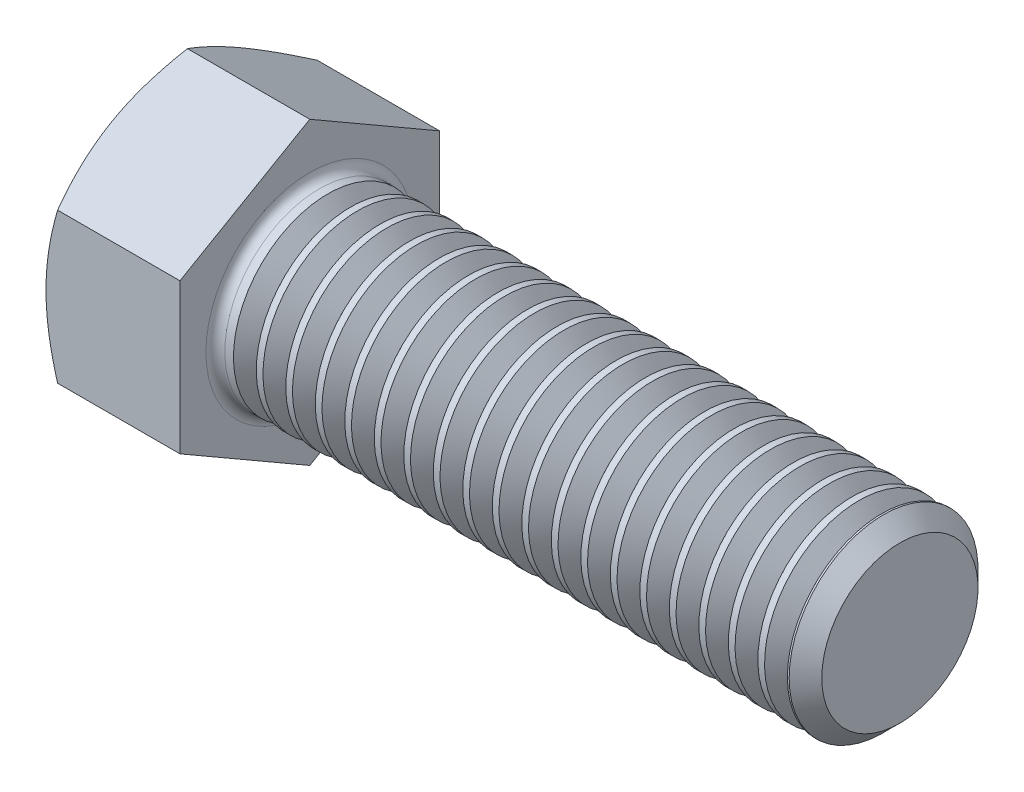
ISO-10303-21;
HEADER;
FILE_DESCRIPTION(('STEP AP214'),'2;1');
FILE_NAME('part.step','',(''),(''),'','','');
FILE_SCHEMA(('AUTOMOTIVE_DESIGN { 1 0 10303 214 1 1 1 1 }'));
ENDSEC;
DATA;
#1=APPLICATION_CONTEXT('core data for automotive mechanical design processes');
#2=APPLICATION_PROTOCOL_DEFINITION('international standard','automotive_design',2000,#1);
#3=PRODUCT_CONTEXT('',#1,'mechanical');
#4=PRODUCT('Part','Part','',(#3));
#5=PRODUCT_RELATED_PRODUCT_CATEGORY('part','',(#4));
#6=PRODUCT_DEFINITION_FORMATION('','',#4);
#7=PRODUCT_DEFINITION_CONTEXT('part definition',#1,'design');
#8=PRODUCT_DEFINITION('design','',#6,#7);
#9=PRODUCT_DEFINITION_SHAPE('','',#8);
#10=(LENGTH_UNIT() NAMED_UNIT(*) SI_UNIT(.MILLI.,.METRE.));
#11=(NAMED_UNIT(*) PLANE_ANGLE_UNIT() SI_UNIT($,.RADIAN.));
#12=(NAMED_UNIT(*) SI_UNIT($,.STERADIAN.) SOLID_ANGLE_UNIT());
#13=UNCERTAINTY_MEASURE_WITH_UNIT(LENGTH_MEASURE(1.E-05),#10,'distance_accuracy_value','');
#14=(GEOMETRIC_REPRESENTATION_CONTEXT(3) GLOBAL_UNCERTAINTY_ASSIGNED_CONTEXT((#13)) GLOBAL_UNIT_ASSIGNED_CONTEXT((#10,
#11,#12)) REPRESENTATION_CONTEXT('',''));
#15=CARTESIAN_POINT('',(0.,0.,0.));
#16=DIRECTION('',(0.,0.,1.));
#17=DIRECTION('',(1.,0.,0.));
#18=AXIS2_PLACEMENT_3D('',#15,#16,#17);
#19=CARTESIAN_POINT('',(5.675,3.17542648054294,-5.5));
#20=DIRECTION('',(0.,-0.866025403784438,0.500000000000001));
#21=DIRECTION('',(0.,-0.500000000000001,-0.866025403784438));
#22=AXIS2_PLACEMENT_3D('',#19,#20,#21);
#23=PLANE('',#22);
#24=CARTESIAN_POINT('',(0.491306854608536,6.35096843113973,0.0002));
#25=CARTESIAN_POINT('',(0.451013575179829,6.28116876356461,-0.120696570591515));
#26=CARTESIAN_POINT('',(0.412548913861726,6.21110884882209,-0.242043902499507));
#27=CARTESIAN_POINT('',(0.339780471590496,6.0704200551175,-0.48572404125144));
#28=CARTESIAN_POINT('',(0.305478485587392,5.99979094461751,-0.608057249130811));
#29=CARTESIAN_POINT('',(0.209489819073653,5.78677273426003,-0.977015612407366));
#30=CARTESIAN_POINT('',(0.154892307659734,5.64354277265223,-1.22509718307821));
#31=CARTESIAN_POINT('',(0.0908698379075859,5.42920173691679,-1.59634674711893));
#32=CARTESIAN_POINT('',(0.0726315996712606,5.35873110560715,-1.71840546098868));
#33=CARTESIAN_POINT('',(0.0420485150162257,5.21747141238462,-1.9630744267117));
#34=CARTESIAN_POINT('',(0.0297031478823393,5.14668237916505,-2.08568462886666));
#35=CARTESIAN_POINT('',(0.011220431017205,5.00498135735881,-2.3311179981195));
#36=CARTESIAN_POINT('',(0.00507603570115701,4.93406960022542,-2.45394076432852));
#37=CARTESIAN_POINT('',(-0.000879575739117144,4.7921844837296,-2.69969299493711));
#38=CARTESIAN_POINT('',(-0.000690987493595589,4.72121112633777,-2.82262245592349));
#39=CARTESIAN_POINT('',(0.00853091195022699,4.52676438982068,-3.15941408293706));
#40=CARTESIAN_POINT('',(0.0240139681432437,4.40335465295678,-3.37316601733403));
#41=CARTESIAN_POINT('',(0.0731121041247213,4.15735486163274,-3.79925015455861));
#42=CARTESIAN_POINT('',(0.106743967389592,4.03476567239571,-4.01158085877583));
#43=CARTESIAN_POINT('',(0.190814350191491,3.7882707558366,-4.43852257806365));
#44=CARTESIAN_POINT('',(0.241609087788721,3.66439613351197,-4.65307971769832));
#45=CARTESIAN_POINT('',(0.356892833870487,3.41849427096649,-5.07899423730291));
#46=CARTESIAN_POINT('',(0.421354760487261,3.29646388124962,-5.29035707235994));
#47=CARTESIAN_POINT('',(0.491306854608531,3.1753110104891,-5.5002));
#48=B_SPLINE_CURVE_WITH_KNOTS('',3,(#24,#25,#26,#27,#28,#29,#30,#31,#32,#33,#34,#35,#36,#37,#38,
#39,#40,#41,#42,#43,#44,#45,#46,#47),.UNSPECIFIED.,.F.,.F.,(4,2,2,2,2,2,2,2,2,2,2,4),(0.,
0.435859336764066,0.871905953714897,1.74581116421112,2.17206086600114,2.59827289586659,
3.02400011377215,3.44971418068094,4.19085033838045,4.93267305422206,5.69094899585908,
6.44773620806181),.UNSPECIFIED.);
#49=CARTESIAN_POINT('',(0.491240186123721,6.35085296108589,0.));
#50=VERTEX_POINT('',#49);
#51=CARTESIAN_POINT('',(0.,4.76313972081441,-2.75000000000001));
#52=VERTEX_POINT('',#51);
#53=EDGE_CURVE('E42',#50,#52,#48,.T.);
#54=ORIENTED_EDGE('',*,*,#53,.F.);
#55=DIRECTION('',(-1.,0.,0.));
#56=VECTOR('',#55,1.);
#57=CARTESIAN_POINT('',(5.675,6.35085296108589,0.));
#58=LINE('',#57,#56);
#59=CARTESIAN_POINT('',(5.675,6.35085296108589,0.));
#60=VERTEX_POINT('',#59);
#61=EDGE_CURVE('E141',#60,#50,#58,.T.);
#62=ORIENTED_EDGE('',*,*,#61,.F.);
#63=DIRECTION('',(0.,0.500000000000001,0.866025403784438));
#64=VECTOR('',#63,1.);
#65=CARTESIAN_POINT('',(5.675,3.17542648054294,-5.5));
#66=LINE('',#65,#64);
#67=CARTESIAN_POINT('',(5.675,3.17542648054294,-5.5));
#68=VERTEX_POINT('',#67);
#69=EDGE_CURVE('E249',#68,#60,#66,.T.);
#70=ORIENTED_EDGE('',*,*,#69,.F.);
#71=DIRECTION('',(-1.,0.,0.));
#72=VECTOR('',#71,1.);
#73=CARTESIAN_POINT('',(5.675,3.17542648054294,-5.5));
#74=LINE('',#73,#72);
#75=CARTESIAN_POINT('',(0.491240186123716,3.17542648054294,-5.5));
#76=VERTEX_POINT('',#75);
#77=EDGE_CURVE('E128',#68,#76,#74,.T.);
#78=ORIENTED_EDGE('',*,*,#77,.T.);
#79=EDGE_CURVE('E122',#52,#76,#48,.T.);
#80=ORIENTED_EDGE('',*,*,#79,.F.);
#81=EDGE_LOOP('',(#54,#62,#70,#78,#80));
#82=FACE_BOUND('',#81,.T.);
#83=ADVANCED_FACE('F27',(#82),#23,.F.);
#84=CARTESIAN_POINT('',(5.675,6.35085296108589,0.));
#85=DIRECTION('',(0.,-0.866025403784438,-0.500000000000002));
#86=DIRECTION('',(0.,0.500000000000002,-0.866025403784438));
#87=AXIS2_PLACEMENT_3D('',#84,#85,#86);
#88=PLANE('',#87);
#89=CARTESIAN_POINT('',(0.491306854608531,3.1753110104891,5.5002));
#90=CARTESIAN_POINT('',(0.451013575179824,3.24511067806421,5.37930342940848));
#91=CARTESIAN_POINT('',(0.412548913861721,3.31517059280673,5.25795609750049));
#92=CARTESIAN_POINT('',(0.339780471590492,3.45585938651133,5.01427595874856));
#93=CARTESIAN_POINT('',(0.305478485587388,3.52648849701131,4.89194275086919));
#94=CARTESIAN_POINT('',(0.20948981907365,3.7395067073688,4.52298438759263));
#95=CARTESIAN_POINT('',(0.154892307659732,3.88273666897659,4.2749028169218));
#96=CARTESIAN_POINT('',(0.0908698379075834,4.09707770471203,3.90365325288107));
#97=CARTESIAN_POINT('',(0.0726315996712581,4.16754833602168,3.78159453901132));
#98=CARTESIAN_POINT('',(0.0420485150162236,4.30880802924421,3.5369255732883));
#99=CARTESIAN_POINT('',(0.0297031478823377,4.37959706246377,3.41431537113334));
#100=CARTESIAN_POINT('',(0.0112204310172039,4.52129808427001,3.1688820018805));
#101=CARTESIAN_POINT('',(0.00507603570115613,4.5922098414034,3.04605923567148));
#102=CARTESIAN_POINT('',(-0.000879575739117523,4.73409495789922,2.8003070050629));
#103=CARTESIAN_POINT('',(-0.000690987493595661,4.80506831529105,2.67737754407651));
#104=CARTESIAN_POINT('',(0.00853091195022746,4.99951505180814,2.34058591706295));
#105=CARTESIAN_POINT('',(0.0240139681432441,5.12292478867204,2.12683398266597));
#106=CARTESIAN_POINT('',(0.0731121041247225,5.36892457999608,1.70074984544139));
#107=CARTESIAN_POINT('',(0.106743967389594,5.49151376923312,1.48841914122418));
#108=CARTESIAN_POINT('',(0.190814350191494,5.73800868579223,1.06147742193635));
#109=CARTESIAN_POINT('',(0.241609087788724,5.86188330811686,0.846920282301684));
#110=CARTESIAN_POINT('',(0.356892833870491,6.10778517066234,0.421005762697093));
#111=CARTESIAN_POINT('',(0.421354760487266,6.2298155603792,0.209642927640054));
#112=CARTESIAN_POINT('',(0.491306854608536,6.35096843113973,-0.000199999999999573));
#113=B_SPLINE_CURVE_WITH_KNOTS('',3,(#89,#90,#91,#92,#93,#94,#95,#96,#97,#98,#99,#100,#101,#102,
#103,#104,#105,#106,#107,#108,#109,#110,#111,#112),.UNSPECIFIED.,.F.,.F.,(4,2,2,2,2,2,2,2,2,2,2,
4),(0.,0.435859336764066,0.871905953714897,1.74581116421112,2.17206086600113,2.59827289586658,
3.02400011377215,3.44971418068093,4.19085033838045,4.93267305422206,5.69094899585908,
6.44773620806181),.UNSPECIFIED.);
#114=CARTESIAN_POINT('',(0.491240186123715,3.17542648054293,5.5));
#115=VERTEX_POINT('',#114);
#116=CARTESIAN_POINT('',(0.,4.76313972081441,2.75000000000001));
#117=VERTEX_POINT('',#116);
#118=EDGE_CURVE('E50',#115,#117,#113,.T.);
#119=ORIENTED_EDGE('',*,*,#118,.F.);
#120=DIRECTION('',(-1.,0.,0.));
#121=VECTOR('',#120,1.);
#122=CARTESIAN_POINT('',(5.675,3.17542648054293,5.5));
#123=LINE('',#122,#121);
#124=CARTESIAN_POINT('',(5.675,3.17542648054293,5.5));
#125=VERTEX_POINT('',#124);
#126=EDGE_CURVE('E138',#125,#115,#123,.T.);
#127=ORIENTED_EDGE('',*,*,#126,.F.);
#128=DIRECTION('',(0.,-0.500000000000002,0.866025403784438));
#129=VECTOR('',#128,1.);
#130=CARTESIAN_POINT('',(5.675,6.35085296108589,0.));
#131=LINE('',#130,#129);
#132=EDGE_CURVE('E244',#60,#125,#131,.T.);
#133=ORIENTED_EDGE('',*,*,#132,.F.);
#134=ORIENTED_EDGE('',*,*,#61,.T.);
#135=EDGE_CURVE('E177',#117,#50,#113,.T.);
#136=ORIENTED_EDGE('',*,*,#135,.F.);
#137=EDGE_LOOP('',(#119,#127,#133,#134,#136));
#138=FACE_BOUND('',#137,.T.);
#139=ADVANCED_FACE('F221',(#138),#88,.F.);
#140=CARTESIAN_POINT('',(5.675,3.17542648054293,5.5));
#141=DIRECTION('',(0.,0.,-1.));
#142=DIRECTION('',(0.,1.,0.));
#143=AXIS2_PLACEMENT_3D('',#140,#141,#142);
#144=PLANE('',#143);
#145=CARTESIAN_POINT('',(2.71299042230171,-8.58896739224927,5.5));
#146=CARTESIAN_POINT('',(2.59596339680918,-8.34820883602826,5.5));
#147=CARTESIAN_POINT('',(2.48004154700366,-8.106903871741,5.5));
#148=CARTESIAN_POINT('',(2.25102871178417,-7.62291071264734,5.5));
#149=CARTESIAN_POINT('',(2.13793816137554,-7.3802223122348,5.5));
#150=CARTESIAN_POINT('',(1.9146523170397,-6.89195012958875,5.5));
#151=CARTESIAN_POINT('',(1.8044756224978,-6.64635781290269,5.5));
#152=CARTESIAN_POINT('',(1.58855337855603,-6.1532401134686,5.5));
#153=CARTESIAN_POINT('',(1.48280762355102,-5.90571482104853,5.5));
#154=CARTESIAN_POINT('',(1.27354294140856,-5.40019079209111,5.5));
#155=CARTESIAN_POINT('',(1.17021032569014,-5.14211451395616,5.5));
#156=CARTESIAN_POINT('',(0.971222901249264,-4.62296480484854,5.5));
#157=CARTESIAN_POINT('',(0.875568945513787,-4.36189104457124,5.5));
#158=CARTESIAN_POINT('',(0.694405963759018,-3.8368004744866,5.5));
#159=CARTESIAN_POINT('',(0.608876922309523,-3.57279063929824,5.5));
#160=CARTESIAN_POINT('',(0.450668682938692,-3.04098443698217,5.5));
#161=CARTESIAN_POINT('',(0.377985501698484,-2.7731892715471,5.5));
#162=CARTESIAN_POINT('',(0.249298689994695,-2.23512352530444,5.5));
#163=CARTESIAN_POINT('',(0.193204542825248,-1.96487499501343,5.5));
#164=CARTESIAN_POINT('',(0.100836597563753,-1.4209562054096,5.5));
#165=CARTESIAN_POINT('',(0.0645607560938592,-1.14728630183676,5.5));
#166=CARTESIAN_POINT('',(0.0151956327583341,-0.60149193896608,5.5));
#167=CARTESIAN_POINT('',(0.00180349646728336,-0.329395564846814,5.5));
#168=CARTESIAN_POINT('',(-0.00145986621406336,0.214964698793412,5.5));
#169=CARTESIAN_POINT('',(0.00866940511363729,0.487228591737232,5.5));
#170=CARTESIAN_POINT('',(0.0449649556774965,0.947643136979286,5.5));
#171=CARTESIAN_POINT('',(0.065340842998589,1.13627937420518,5.5));
#172=CARTESIAN_POINT('',(0.116147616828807,1.51220194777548,5.5));
#173=CARTESIAN_POINT('',(0.146579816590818,1.69948810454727,5.5));
#174=CARTESIAN_POINT('',(0.251364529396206,2.25904957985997,5.5));
#175=CARTESIAN_POINT('',(0.33918764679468,2.62883216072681,5.5));
#176=CARTESIAN_POINT('',(0.491898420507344,3.18196143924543,5.5));
#177=CARTESIAN_POINT('',(0.547040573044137,3.36816212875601,5.5));
#178=CARTESIAN_POINT('',(0.663152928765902,3.73875498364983,5.5));
#179=CARTESIAN_POINT('',(0.724123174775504,3.92314713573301,5.5));
#180=CARTESIAN_POINT('',(0.85090474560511,4.29018125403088,5.5));
#181=CARTESIAN_POINT('',(0.916714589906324,4.47282373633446,5.5));
#182=CARTESIAN_POINT('',(1.0523908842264,4.83658683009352,5.5));
#183=CARTESIAN_POINT('',(1.12225725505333,5.01770747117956,5.5));
#184=CARTESIAN_POINT('',(1.30925234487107,5.48925342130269,5.5));
#185=CARTESIAN_POINT('',(1.42909224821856,5.77860235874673,5.5));
#186=CARTESIAN_POINT('',(1.67541354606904,6.35446928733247,5.5));
#187=CARTESIAN_POINT('',(1.80189557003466,6.6409870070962,5.5));
#188=CARTESIAN_POINT('',(2.05998871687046,7.21181077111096,5.5));
#189=CARTESIAN_POINT('',(2.19160153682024,7.49611604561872,5.5));
#190=CARTESIAN_POINT('',(2.45877750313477,8.06284653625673,5.5));
#191=CARTESIAN_POINT('',(2.59434051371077,8.34527181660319,5.5));
#192=CARTESIAN_POINT('',(2.86878432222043,8.90900922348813,5.5));
#193=CARTESIAN_POINT('',(3.00766964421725,9.19031914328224,5.5));
#194=CARTESIAN_POINT('',(3.28794742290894,9.75168741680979,5.5));
#195=CARTESIAN_POINT('',(3.42933989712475,10.0317457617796,5.5));
#196=CARTESIAN_POINT('',(3.85648165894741,10.8702730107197,5.5));
#197=CARTESIAN_POINT('',(4.14524920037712,11.4272038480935,5.5));
#198=CARTESIAN_POINT('',(4.69911652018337,12.4827236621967,5.5));
#199=CARTESIAN_POINT('',(4.96370008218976,12.9815848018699,5.5));
#200=CARTESIAN_POINT('',(5.4961318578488,13.9775950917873,5.5));
#201=CARTESIAN_POINT('',(5.76398024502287,14.4747441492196,5.5));
#202=CARTESIAN_POINT('',(6.30127874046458,15.4661899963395,5.5));
#203=CARTESIAN_POINT('',(6.57072135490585,15.9604908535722,5.5));
#204=CARTESIAN_POINT('',(7.11148251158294,16.9480201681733,5.5));
#205=CARTESIAN_POINT('',(7.38280091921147,17.4412486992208,5.5));
#206=CARTESIAN_POINT('',(7.65480584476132,17.9340959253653,5.5));
#207=B_SPLINE_CURVE_WITH_KNOTS('',3,(#145,#146,#147,#148,#149,#150,#151,#152,#153,#154,#155,
#156,#157,#158,#159,#160,#161,#162,#163,#164,#165,#166,#167,#168,#169,#170,#171,#172,#173,#174,
#175,#176,#177,#178,#179,#180,#181,#182,#183,#184,#185,#186,#187,#188,#189,#190,#191,#192,#193,
#194,#195,#196,#197,#198,#199,#200,#201,#202,#203,#204,#205,#206),.UNSPECIFIED.,.F.,.F.,(4,2,2,
2,2,2,2,2,2,2,2,2,2,2,2,2,2,2,2,2,2,2,2,2,2,2,2,2,2,2,4),(0.,0.803091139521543,1.60630491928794,
2.41379099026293,3.22123955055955,4.0551288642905,4.88911068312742,5.72141529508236,
6.55346136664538,7.38087993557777,8.20821317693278,9.02450974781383,9.84082359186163,
10.4097494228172,10.9787495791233,12.1173367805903,12.6998681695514,13.2824038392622,
13.8647620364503,14.4471088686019,15.3865407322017,16.3260617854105,17.2658962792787,
18.2056985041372,19.1468628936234,20.088033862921,21.9700090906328,23.6640456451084,
25.3581726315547,27.047071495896,28.7358503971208),.UNSPECIFIED.);
#208=CARTESIAN_POINT('',(0.491240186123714,-3.17542648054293,5.5));
#209=VERTEX_POINT('',#208);
#210=CARTESIAN_POINT('',(0.,0.,5.5));
#211=VERTEX_POINT('',#210);
#212=EDGE_CURVE('E175',#209,#211,#207,.T.);
#213=ORIENTED_EDGE('',*,*,#212,.F.);
#214=DIRECTION('',(-1.,0.,0.));
#215=VECTOR('',#214,1.);
#216=CARTESIAN_POINT('',(5.675,-3.17542648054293,5.5));
#217=LINE('',#216,#215);
#218=CARTESIAN_POINT('',(5.675,-3.17542648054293,5.5));
#219=VERTEX_POINT('',#218);
#220=EDGE_CURVE('E130',#219,#209,#217,.T.);
#221=ORIENTED_EDGE('',*,*,#220,.F.);
#222=DIRECTION('',(0.,-1.,0.));
#223=VECTOR('',#222,1.);
#224=CARTESIAN_POINT('',(5.675,3.17542648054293,5.5));
#225=LINE('',#224,#223);
#226=EDGE_CURVE('E248',#125,#219,#225,.T.);
#227=ORIENTED_EDGE('',*,*,#226,.F.);
#228=ORIENTED_EDGE('',*,*,#126,.T.);
#229=EDGE_CURVE('E173',#211,#115,#207,.T.);
#230=ORIENTED_EDGE('',*,*,#229,.F.);
#231=EDGE_LOOP('',(#213,#221,#227,#228,#230));
#232=FACE_BOUND('',#231,.T.);
#233=ADVANCED_FACE('F224',(#232),#144,.F.);
#234=CARTESIAN_POINT('',(5.675,-6.35085296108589,0.));
#235=DIRECTION('',(0.,0.866025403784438,-0.500000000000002));
#236=DIRECTION('',(0.,0.500000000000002,0.866025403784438));
#237=AXIS2_PLACEMENT_3D('',#234,#235,#236);
#238=PLANE('',#237);
#239=CARTESIAN_POINT('',(0.491306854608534,-6.35096843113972,-0.000200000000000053));
#240=CARTESIAN_POINT('',(0.451013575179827,-6.28116876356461,0.120696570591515));
#241=CARTESIAN_POINT('',(0.412548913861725,-6.21110884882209,0.242043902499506));
#242=CARTESIAN_POINT('',(0.339780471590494,-6.07042005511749,0.48572404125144));
#243=CARTESIAN_POINT('',(0.30547848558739,-5.99979094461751,0.608057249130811));
#244=CARTESIAN_POINT('',(0.209489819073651,-5.78677273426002,0.977015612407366));
#245=CARTESIAN_POINT('',(0.154892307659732,-5.64354277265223,1.22509718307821));
#246=CARTESIAN_POINT('',(0.0908698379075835,-5.42920173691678,1.59634674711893));
#247=CARTESIAN_POINT('',(0.072631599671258,-5.35873110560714,1.71840546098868));
#248=CARTESIAN_POINT('',(0.042048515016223,-5.21747141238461,1.9630744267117));
#249=CARTESIAN_POINT('',(0.0297031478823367,-5.14668237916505,2.08568462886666));
#250=CARTESIAN_POINT('',(0.0112204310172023,-5.0049813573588,2.3311179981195));
#251=CARTESIAN_POINT('',(0.00507603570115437,-4.93406960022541,2.45394076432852));
#252=CARTESIAN_POINT('',(-0.000879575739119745,-4.79218448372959,2.6996929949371));
#253=CARTESIAN_POINT('',(-0.000690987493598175,-4.72121112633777,2.82262245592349));
#254=CARTESIAN_POINT('',(0.00853091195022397,-4.52676438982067,3.15941408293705));
#255=CARTESIAN_POINT('',(0.0240139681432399,-4.40335465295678,3.37316601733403));
#256=CARTESIAN_POINT('',(0.0731121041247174,-4.15735486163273,3.79925015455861));
#257=CARTESIAN_POINT('',(0.106743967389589,-4.0347656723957,4.01158085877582));
#258=CARTESIAN_POINT('',(0.190814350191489,-3.78827075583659,4.43852257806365));
#259=CARTESIAN_POINT('',(0.241609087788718,-3.66439613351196,4.65307971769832));
#260=CARTESIAN_POINT('',(0.356892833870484,-3.41849427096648,5.07899423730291));
#261=CARTESIAN_POINT('',(0.421354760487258,-3.29646388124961,5.29035707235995));
#262=CARTESIAN_POINT('',(0.491306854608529,-3.17531101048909,5.5002));
#263=B_SPLINE_CURVE_WITH_KNOTS('',3,(#239,#240,#241,#242,#243,#244,#245,#246,#247,#248,#249,
#250,#251,#252,#253,#254,#255,#256,#257,#258,#259,#260,#261,#262),.UNSPECIFIED.,.F.,.F.,(4,2,2,
2,2,2,2,2,2,2,2,4),(0.,0.435859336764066,0.871905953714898,1.74581116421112,2.17206086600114,
2.59827289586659,3.02400011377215,3.44971418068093,4.19085033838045,4.93267305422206,
5.69094899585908,6.44773620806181),.UNSPECIFIED.);
#264=CARTESIAN_POINT('',(0.491240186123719,-6.35085296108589,0.));
#265=VERTEX_POINT('',#264);
#266=CARTESIAN_POINT('',(0.,-4.76313972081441,2.75000000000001));
#267=VERTEX_POINT('',#266);
#268=EDGE_CURVE('E161',#265,#267,#263,.T.);
#269=ORIENTED_EDGE('',*,*,#268,.F.);
#270=DIRECTION('',(-1.,0.,0.));
#271=VECTOR('',#270,1.);
#272=CARTESIAN_POINT('',(5.675,-6.35085296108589,0.));
#273=LINE('',#272,#271);
#274=CARTESIAN_POINT('',(5.675,-6.35085296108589,0.));
#275=VERTEX_POINT('',#274);
#276=EDGE_CURVE('E127',#275,#265,#273,.T.);
#277=ORIENTED_EDGE('',*,*,#276,.F.);
#278=DIRECTION('',(0.,-0.500000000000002,-0.866025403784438));
#279=VECTOR('',#278,1.);
#280=CARTESIAN_POINT('',(5.675,-6.35085296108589,0.));
#281=LINE('',#280,#279);
#282=EDGE_CURVE('E259',#219,#275,#281,.T.);
#283=ORIENTED_EDGE('',*,*,#282,.F.);
#284=ORIENTED_EDGE('',*,*,#220,.T.);
#285=EDGE_CURVE('E167',#267,#209,#263,.T.);
#286=ORIENTED_EDGE('',*,*,#285,.F.);
#287=EDGE_LOOP('',(#269,#277,#283,#284,#286));
#288=FACE_BOUND('',#287,.T.);
#289=ADVANCED_FACE('F168',(#288),#238,.F.);
#290=CARTESIAN_POINT('',(5.675,-3.17542648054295,-5.5));
#291=DIRECTION('',(0.,0.866025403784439,0.5));
#292=DIRECTION('',(0.,-0.5,0.866025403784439));
#293=AXIS2_PLACEMENT_3D('',#290,#291,#292);
#294=PLANE('',#293);
#295=CARTESIAN_POINT('',(0.491306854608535,-3.17531101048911,-5.5002));
#296=CARTESIAN_POINT('',(0.451013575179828,-3.24511067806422,-5.37930342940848));
#297=CARTESIAN_POINT('',(0.412548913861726,-3.31517059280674,-5.25795609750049));
#298=CARTESIAN_POINT('',(0.339780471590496,-3.45585938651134,-5.01427595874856));
#299=CARTESIAN_POINT('',(0.305478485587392,-3.52648849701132,-4.89194275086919));
#300=CARTESIAN_POINT('',(0.209489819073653,-3.73950670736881,-4.52298438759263));
#301=CARTESIAN_POINT('',(0.154892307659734,-3.8827366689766,-4.27490281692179));
#302=CARTESIAN_POINT('',(0.0908698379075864,-4.09707770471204,-3.90365325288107));
#303=CARTESIAN_POINT('',(0.0726315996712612,-4.16754833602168,-3.78159453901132));
#304=CARTESIAN_POINT('',(0.0420485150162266,-4.30880802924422,-3.5369255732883));
#305=CARTESIAN_POINT('',(0.0297031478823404,-4.37959706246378,-3.41431537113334));
#306=CARTESIAN_POINT('',(0.0112204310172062,-4.52129808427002,-3.1688820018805));
#307=CARTESIAN_POINT('',(0.00507603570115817,-4.59220984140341,-3.04605923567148));
#308=CARTESIAN_POINT('',(-0.00087957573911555,-4.73409495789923,-2.80030700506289));
#309=CARTESIAN_POINT('',(-0.000690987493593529,-4.80506831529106,-2.6773775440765));
#310=CARTESIAN_POINT('',(0.00853091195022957,-4.99951505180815,-2.34058591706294));
#311=CARTESIAN_POINT('',(0.0240139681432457,-5.12292478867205,-2.12683398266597));
#312=CARTESIAN_POINT('',(0.0731121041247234,-5.36892457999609,-1.70074984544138));
#313=CARTESIAN_POINT('',(0.106743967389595,-5.49151376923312,-1.48841914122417));
#314=CARTESIAN_POINT('',(0.190814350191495,-5.73800868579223,-1.06147742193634));
#315=CARTESIAN_POINT('',(0.241609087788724,-5.86188330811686,-0.846920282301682));
#316=CARTESIAN_POINT('',(0.356892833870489,-6.10778517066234,-0.421005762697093));
#317=CARTESIAN_POINT('',(0.421354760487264,-6.2298155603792,-0.209642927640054));
#318=CARTESIAN_POINT('',(0.491306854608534,-6.35096843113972,0.000199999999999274));
#319=B_SPLINE_CURVE_WITH_KNOTS('',3,(#295,#296,#297,#298,#299,#300,#301,#302,#303,#304,#305,
#306,#307,#308,#309,#310,#311,#312,#313,#314,#315,#316,#317,#318),.UNSPECIFIED.,.F.,.F.,(4,2,2,
2,2,2,2,2,2,2,2,4),(0.,0.435859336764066,0.871905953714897,1.74581116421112,2.17206086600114,
2.59827289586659,3.02400011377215,3.44971418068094,4.19085033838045,4.93267305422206,
5.69094899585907,6.4477362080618),.UNSPECIFIED.);
#320=CARTESIAN_POINT('',(0.49124018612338,-3.17542648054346,-5.5));
#321=VERTEX_POINT('',#320);
#322=CARTESIAN_POINT('',(0.,-4.76313972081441,-2.75));
#323=VERTEX_POINT('',#322);
#324=EDGE_CURVE('E103',#321,#323,#319,.T.);
#325=ORIENTED_EDGE('',*,*,#324,.F.);
#326=DIRECTION('',(-1.,0.,0.));
#327=VECTOR('',#326,1.);
#328=CARTESIAN_POINT('',(5.675,-3.17542648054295,-5.5));
#329=LINE('',#328,#327);
#330=CARTESIAN_POINT('',(5.675,-3.17542648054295,-5.5));
#331=VERTEX_POINT('',#330);
#332=EDGE_CURVE('E118',#331,#321,#329,.T.);
#333=ORIENTED_EDGE('',*,*,#332,.F.);
#334=DIRECTION('',(0.,0.5,-0.866025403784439));
#335=VECTOR('',#334,1.);
#336=CARTESIAN_POINT('',(5.675,-3.17542648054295,-5.5));
#337=LINE('',#336,#335);
#338=EDGE_CURVE('E261',#275,#331,#337,.T.);
#339=ORIENTED_EDGE('',*,*,#338,.F.);
#340=ORIENTED_EDGE('',*,*,#276,.T.);
#341=EDGE_CURVE('E121',#323,#265,#319,.T.);
#342=ORIENTED_EDGE('',*,*,#341,.F.);
#343=EDGE_LOOP('',(#325,#333,#339,#340,#342));
#344=FACE_BOUND('',#343,.T.);
#345=ADVANCED_FACE('F116',(#344),#294,.F.);
#346=CARTESIAN_POINT('',(5.675,3.17542648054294,-5.5));
#347=DIRECTION('',(0.,0.,1.));
#348=DIRECTION('',(0.,-1.,0.));
#349=AXIS2_PLACEMENT_3D('',#346,#347,#348);
#350=PLANE('',#349);
#351=CARTESIAN_POINT('',(2.71299042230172,-8.5889673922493,-5.5));
#352=CARTESIAN_POINT('',(2.59596339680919,-8.34820883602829,-5.5));
#353=CARTESIAN_POINT('',(2.48004154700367,-8.10690387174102,-5.5));
#354=CARTESIAN_POINT('',(2.25102871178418,-7.62291071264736,-5.5));
#355=CARTESIAN_POINT('',(2.13793816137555,-7.38022231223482,-5.5));
#356=CARTESIAN_POINT('',(1.91465231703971,-6.89195012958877,-5.5));
#357=CARTESIAN_POINT('',(1.80447562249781,-6.64635781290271,-5.5));
#358=CARTESIAN_POINT('',(1.58855337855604,-6.15324011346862,-5.5));
#359=CARTESIAN_POINT('',(1.48280762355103,-5.90571482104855,-5.5));
#360=CARTESIAN_POINT('',(1.27354294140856,-5.40019079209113,-5.5));
#361=CARTESIAN_POINT('',(1.17021032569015,-5.14211451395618,-5.5));
#362=CARTESIAN_POINT('',(0.971222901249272,-4.62296480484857,-5.5));
#363=CARTESIAN_POINT('',(0.875568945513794,-4.36189104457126,-5.5));
#364=CARTESIAN_POINT('',(0.694405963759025,-3.83680047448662,-5.5));
#365=CARTESIAN_POINT('',(0.60887692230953,-3.57279063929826,-5.5));
#366=CARTESIAN_POINT('',(0.450668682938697,-3.04098443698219,-5.5));
#367=CARTESIAN_POINT('',(0.377985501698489,-2.77318927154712,-5.5));
#368=CARTESIAN_POINT('',(0.249298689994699,-2.23512352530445,-5.5));
#369=CARTESIAN_POINT('',(0.193204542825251,-1.96487499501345,-5.5));
#370=CARTESIAN_POINT('',(0.100836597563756,-1.42095620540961,-5.5));
#371=CARTESIAN_POINT('',(0.0645607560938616,-1.14728630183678,-5.5));
#372=CARTESIAN_POINT('',(0.0151956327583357,-0.601491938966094,-5.5));
#373=CARTESIAN_POINT('',(0.00180349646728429,-0.329395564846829,-5.5));
#374=CARTESIAN_POINT('',(-0.00145986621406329,0.214964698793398,-5.5));
#375=CARTESIAN_POINT('',(0.00866940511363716,0.487228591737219,-5.5));
#376=CARTESIAN_POINT('',(0.0449649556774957,0.947643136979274,-5.5));
#377=CARTESIAN_POINT('',(0.0653408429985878,1.13627937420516,-5.5));
#378=CARTESIAN_POINT('',(0.116147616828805,1.51220194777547,-5.5));
#379=CARTESIAN_POINT('',(0.146579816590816,1.69948810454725,-5.5));
#380=CARTESIAN_POINT('',(0.251364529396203,2.25904957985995,-5.5));
#381=CARTESIAN_POINT('',(0.339187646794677,2.62883216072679,-5.5));
#382=CARTESIAN_POINT('',(0.491898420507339,3.18196143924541,-5.5));
#383=CARTESIAN_POINT('',(0.547040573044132,3.36816212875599,-5.5));
#384=CARTESIAN_POINT('',(0.663152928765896,3.73875498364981,-5.5));
#385=CARTESIAN_POINT('',(0.724123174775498,3.923147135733,-5.5));
#386=CARTESIAN_POINT('',(0.850904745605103,4.29018125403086,-5.5));
#387=CARTESIAN_POINT('',(0.916714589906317,4.47282373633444,-5.5));
#388=CARTESIAN_POINT('',(1.05239088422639,4.8365868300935,-5.5));
#389=CARTESIAN_POINT('',(1.12225725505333,5.01770747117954,-5.5));
#390=CARTESIAN_POINT('',(1.30925234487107,5.48925342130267,-5.5));
#391=CARTESIAN_POINT('',(1.42909224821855,5.77860235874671,-5.5));
#392=CARTESIAN_POINT('',(1.67541354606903,6.35446928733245,-5.5));
#393=CARTESIAN_POINT('',(1.80189557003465,6.64098700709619,-5.5));
#394=CARTESIAN_POINT('',(2.05998871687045,7.21181077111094,-5.5));
#395=CARTESIAN_POINT('',(2.19160153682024,7.49611604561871,-5.5));
#396=CARTESIAN_POINT('',(2.45877750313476,8.06284653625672,-5.5));
#397=CARTESIAN_POINT('',(2.59434051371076,8.34527181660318,-5.5));
#398=CARTESIAN_POINT('',(2.86878432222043,8.90900922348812,-5.5));
#399=CARTESIAN_POINT('',(3.00766964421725,9.19031914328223,-5.5));
#400=CARTESIAN_POINT('',(3.28794742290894,9.75168741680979,-5.5));
#401=CARTESIAN_POINT('',(3.42933989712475,10.0317457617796,-5.5));
#402=CARTESIAN_POINT('',(3.85648165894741,10.8702730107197,-5.5));
#403=CARTESIAN_POINT('',(4.14524920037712,11.4272038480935,-5.5));
#404=CARTESIAN_POINT('',(4.69911652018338,12.4827236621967,-5.5));
#405=CARTESIAN_POINT('',(4.96370008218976,12.9815848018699,-5.5));
#406=CARTESIAN_POINT('',(5.4961318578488,13.9775950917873,-5.5));
#407=CARTESIAN_POINT('',(5.76398024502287,14.4747441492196,-5.5));
#408=CARTESIAN_POINT('',(6.30127874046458,15.4661899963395,-5.5));
#409=CARTESIAN_POINT('',(6.57072135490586,15.9604908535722,-5.5));
#410=CARTESIAN_POINT('',(7.11148251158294,16.9480201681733,-5.5));
#411=CARTESIAN_POINT('',(7.38280091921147,17.4412486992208,-5.5));
#412=CARTESIAN_POINT('',(7.65480584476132,17.9340959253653,-5.5));
#413=B_SPLINE_CURVE_WITH_KNOTS('',3,(#351,#352,#353,#354,#355,#356,#357,#358,#359,#360,#361,
#362,#363,#364,#365,#366,#367,#368,#369,#370,#371,#372,#373,#374,#375,#376,#377,#378,#379,#380,
#381,#382,#383,#384,#385,#386,#387,#388,#389,#390,#391,#392,#393,#394,#395,#396,#397,#398,#399,
#400,#401,#402,#403,#404,#405,#406,#407,#408,#409,#410,#411,#412),.UNSPECIFIED.,.F.,.F.,(4,2,2,
2,2,2,2,2,2,2,2,2,2,2,2,2,2,2,2,2,2,2,2,2,2,2,2,2,2,2,4),(0.,0.803091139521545,1.60630491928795,
2.41379099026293,3.22123955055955,4.0551288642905,4.88911068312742,5.72141529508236,
6.55346136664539,7.38087993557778,8.20821317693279,9.02450974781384,9.84082359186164,
10.4097494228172,10.9787495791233,12.1173367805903,12.6998681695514,13.2824038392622,
13.8647620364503,14.4471088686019,15.3865407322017,16.3260617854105,17.2658962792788,
18.2056985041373,19.1468628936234,20.088033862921,21.9700090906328,23.6640456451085,
25.3581726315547,27.047071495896,28.7358503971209),.UNSPECIFIED.);
#414=CARTESIAN_POINT('',(0.,0.,-5.5));
#415=VERTEX_POINT('',#414);
#416=EDGE_CURVE('E110',#76,#415,#413,.F.);
#417=ORIENTED_EDGE('',*,*,#416,.F.);
#418=ORIENTED_EDGE('',*,*,#77,.F.);
#419=DIRECTION('',(0.,1.,0.));
#420=VECTOR('',#419,1.);
#421=CARTESIAN_POINT('',(5.675,3.17542648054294,-5.5));
#422=LINE('',#421,#420);
#423=EDGE_CURVE('E126',#331,#68,#422,.T.);
#424=ORIENTED_EDGE('',*,*,#423,.F.);
#425=ORIENTED_EDGE('',*,*,#332,.T.);
#426=EDGE_CURVE('E100',#415,#321,#413,.F.);
#427=ORIENTED_EDGE('',*,*,#426,.F.);
#428=EDGE_LOOP('',(#417,#418,#424,#425,#427));
#429=FACE_BOUND('',#428,.T.);
#430=ADVANCED_FACE('F124',(#429),#350,.F.);
#431=CARTESIAN_POINT('',(5.675,6.35085296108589,0.));
#432=DIRECTION('',(1.,0.,0.));
#433=DIRECTION('',(0.,0.,-1.));
#434=AXIS2_PLACEMENT_3D('',#431,#432,#433);
#435=PLANE('',#434);
#436=CARTESIAN_POINT('',(5.675,0.,0.));
#437=DIRECTION('',(1.,0.,0.));
#438=DIRECTION('',(0.,0.,-1.));
#439=AXIS2_PLACEMENT_3D('',#436,#437,#438);
#440=CIRCLE('',#439,4.4);
#441=CARTESIAN_POINT('',(5.675,0.,-4.4));
#442=VERTEX_POINT('',#441);
#443=EDGE_CURVE('E35',#442,#442,#440,.F.);
#444=ORIENTED_EDGE('',*,*,#443,.T.);
#445=EDGE_LOOP('',(#444));
#446=FACE_BOUND('',#445,.T.);
#447=ORIENTED_EDGE('',*,*,#69,.T.);
#448=ORIENTED_EDGE('',*,*,#132,.T.);
#449=ORIENTED_EDGE('',*,*,#226,.T.);
#450=ORIENTED_EDGE('',*,*,#282,.T.);
#451=ORIENTED_EDGE('',*,*,#338,.T.);
#452=ORIENTED_EDGE('',*,*,#423,.T.);
#453=EDGE_LOOP('',(#447,#448,#449,#450,#451,#452));
#454=FACE_BOUND('',#453,.T.);
#455=ADVANCED_FACE('F251',(#446,#454),#435,.T.);
#456=CARTESIAN_POINT('',(0.,0.,0.));
#457=DIRECTION('',(-1.,0.,0.));
#458=DIRECTION('',(0.,0.,1.));
#459=AXIS2_PLACEMENT_3D('',#456,#457,#458);
#460=CYLINDRICAL_SURFACE('',#459,4.);
#461=CARTESIAN_POINT('',(6.44150669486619,0.,0.));
#462=DIRECTION('',(-1.,0.,0.));
#463=DIRECTION('',(0.,-1.,0.));
#464=AXIS2_PLACEMENT_3D('',#461,#462,#463);
#465=CIRCLE('',#464,4.);
#466=CARTESIAN_POINT('',(6.44150669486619,-4.,0.));
#467=VERTEX_POINT('',#466);
#468=EDGE_CURVE('E459',#467,#467,#465,.T.);
#469=ORIENTED_EDGE('',*,*,#468,.T.);
#470=EDGE_LOOP('',(#469));
#471=FACE_BOUND('',#470,.T.);
#472=CARTESIAN_POINT('',(6.075,0.,0.));
#473=DIRECTION('',(1.,0.,0.));
#474=DIRECTION('',(0.,0.,-1.));
#475=AXIS2_PLACEMENT_3D('',#472,#473,#474);
#476=CIRCLE('',#475,4.);
#477=CARTESIAN_POINT('',(6.075,0.,-4.));
#478=VERTEX_POINT('',#477);
#479=EDGE_CURVE('E12',#478,#478,#476,.T.);
#480=ORIENTED_EDGE('',*,*,#479,.T.);
#481=EDGE_LOOP('',(#480));
#482=FACE_BOUND('',#481,.T.);
#483=ADVANCED_FACE('F632',(#471,#482),#460,.T.);
#484=CARTESIAN_POINT('',(0.,0.,0.));
#485=DIRECTION('',(1.,0.,0.));
#486=DIRECTION('',(0.,0.,-1.));
#487=AXIS2_PLACEMENT_3D('',#484,#485,#486);
#488=CONICAL_SURFACE('',#487,5.5,1.0471975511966);
#489=ORIENTED_EDGE('',*,*,#324,.T.);
#490=CARTESIAN_POINT('',(0.,0.,0.));
#491=DIRECTION('',(1.,0.,0.));
#492=DIRECTION('',(0.,0.,-1.));
#493=AXIS2_PLACEMENT_3D('',#490,#491,#492);
#494=CIRCLE('',#493,5.5);
#495=EDGE_CURVE('E105',#323,#415,#494,.T.);
#496=ORIENTED_EDGE('',*,*,#495,.T.);
#497=ORIENTED_EDGE('',*,*,#426,.T.);
#498=EDGE_LOOP('',(#489,#496,#497));
#499=FACE_BOUND('',#498,.T.);
#500=ADVANCED_FACE('F102',(#499),#488,.T.);
#501=ORIENTED_EDGE('',*,*,#268,.T.);
#502=EDGE_CURVE('E144',#267,#323,#494,.T.);
#503=ORIENTED_EDGE('',*,*,#502,.T.);
#504=ORIENTED_EDGE('',*,*,#341,.T.);
#505=EDGE_LOOP('',(#501,#503,#504));
#506=FACE_BOUND('',#505,.T.);
#507=ADVANCED_FACE('F159',(#506),#488,.T.);
#508=ORIENTED_EDGE('',*,*,#212,.T.);
#509=EDGE_CURVE('E152',#211,#267,#494,.T.);
#510=ORIENTED_EDGE('',*,*,#509,.T.);
#511=ORIENTED_EDGE('',*,*,#285,.T.);
#512=EDGE_LOOP('',(#508,#510,#511));
#513=FACE_BOUND('',#512,.T.);
#514=ADVANCED_FACE('F198',(#513),#488,.T.);
#515=ORIENTED_EDGE('',*,*,#229,.T.);
#516=ORIENTED_EDGE('',*,*,#118,.T.);
#517=CARTESIAN_POINT('',(0.,0.,0.));
#518=DIRECTION('',(-1.,0.,0.));
#519=DIRECTION('',(0.,0.,1.));
#520=AXIS2_PLACEMENT_3D('',#517,#518,#519);
#521=CIRCLE('',#520,5.5);
#522=EDGE_CURVE('E111',#211,#117,#521,.T.);
#523=ORIENTED_EDGE('',*,*,#522,.F.);
#524=EDGE_LOOP('',(#515,#516,#523));
#525=FACE_BOUND('',#524,.T.);
#526=ADVANCED_FACE('F203',(#525),#488,.T.);
#527=ORIENTED_EDGE('',*,*,#135,.T.);
#528=ORIENTED_EDGE('',*,*,#53,.T.);
#529=EDGE_CURVE('E149',#52,#117,#494,.T.);
#530=ORIENTED_EDGE('',*,*,#529,.T.);
#531=EDGE_LOOP('',(#527,#528,#530));
#532=FACE_BOUND('',#531,.T.);
#533=ADVANCED_FACE('F936',(#532),#488,.T.);
#534=ORIENTED_EDGE('',*,*,#79,.T.);
#535=ORIENTED_EDGE('',*,*,#416,.T.);
#536=EDGE_CURVE('E145',#415,#52,#494,.T.);
#537=ORIENTED_EDGE('',*,*,#536,.T.);
#538=EDGE_LOOP('',(#534,#535,#537));
#539=FACE_BOUND('',#538,.T.);
#540=ADVANCED_FACE('F643',(#539),#488,.T.);
#541=CARTESIAN_POINT('',(0.,6.35085296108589,0.));
#542=DIRECTION('',(1.,0.,0.));
#543=DIRECTION('',(0.,0.,-1.));
#544=AXIS2_PLACEMENT_3D('',#541,#542,#543);
#545=PLANE('',#544);
#546=ORIENTED_EDGE('',*,*,#536,.F.);
#547=ORIENTED_EDGE('',*,*,#495,.F.);
#548=ORIENTED_EDGE('',*,*,#502,.F.);
#549=ORIENTED_EDGE('',*,*,#509,.F.);
#550=ORIENTED_EDGE('',*,*,#522,.T.);
#551=ORIENTED_EDGE('',*,*,#529,.F.);
#552=EDGE_LOOP('',(#546,#547,#548,#549,#550,#551));
#553=FACE_BOUND('',#552,.T.);
#554=ADVANCED_FACE('F164',(#553),#545,.F.);
#555=CARTESIAN_POINT('',(6.075,0.,0.));
#556=DIRECTION('',(1.,0.,0.));
#557=DIRECTION('',(0.,0.,-1.));
#558=AXIS2_PLACEMENT_3D('',#555,#556,#557);
#559=TOROIDAL_SURFACE('',#558,4.4,0.4);
#560=ORIENTED_EDGE('',*,*,#479,.F.);
#561=EDGE_LOOP('',(#560));
#562=FACE_BOUND('',#561,.T.);
#563=ORIENTED_EDGE('',*,*,#443,.F.);
#564=EDGE_LOOP('',(#563));
#565=FACE_BOUND('',#564,.T.);
#566=ADVANCED_FACE('F204',(#562,#565),#559,.F.);
#567=CARTESIAN_POINT('',(7.40849330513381,0.,0.));
#568=DIRECTION('',(1.,0.,0.));
#569=DIRECTION('',(0.,1.,0.));
#570=AXIS2_PLACEMENT_3D('',#567,#568,#569);
#571=CONICAL_SURFACE('',#570,4.,0.959931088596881);
#572=CARTESIAN_POINT('',(6.925,0.,0.));
#573=DIRECTION('',(-1.,0.,0.));
#574=DIRECTION('',(0.,-1.,0.));
#575=AXIS2_PLACEMENT_3D('',#572,#573,#574);
#576=CIRCLE('',#575,3.3095);
#577=CARTESIAN_POINT('',(6.925,-3.3095,0.));
#578=VERTEX_POINT('',#577);
#579=EDGE_CURVE('E454',#578,#578,#576,.T.);
#580=ORIENTED_EDGE('',*,*,#579,.F.);
#581=EDGE_LOOP('',(#580));
#582=FACE_BOUND('',#581,.T.);
#583=CARTESIAN_POINT('',(7.40849330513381,0.,0.));
#584=DIRECTION('',(-1.,0.,0.));
#585=DIRECTION('',(0.,-1.,0.));
#586=AXIS2_PLACEMENT_3D('',#583,#584,#585);
#587=CIRCLE('',#586,4.);
#588=CARTESIAN_POINT('',(7.40849330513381,-4.,0.));
#589=VERTEX_POINT('',#588);
#590=EDGE_CURVE('E457',#589,#589,#587,.T.);
#591=ORIENTED_EDGE('',*,*,#590,.T.);
#592=EDGE_LOOP('',(#591));
#593=FACE_BOUND('',#592,.T.);
#594=ADVANCED_FACE('F442',(#582,#593),#571,.T.);
#595=CARTESIAN_POINT('',(6.925,0.,0.));
#596=DIRECTION('',(-1.,0.,0.));
#597=DIRECTION('',(0.,-1.,0.));
#598=AXIS2_PLACEMENT_3D('',#595,#596,#597);
#599=CONICAL_SURFACE('',#598,3.3095,0.959931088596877);
#600=ORIENTED_EDGE('',*,*,#468,.F.);
#601=EDGE_LOOP('',(#600));
#602=FACE_BOUND('',#601,.T.);
#603=ORIENTED_EDGE('',*,*,#579,.T.);
#604=EDGE_LOOP('',(#603));
#605=FACE_BOUND('',#604,.T.);
#606=ADVANCED_FACE('F440',(#602,#605),#599,.T.);
#607=CARTESIAN_POINT('',(7.69150669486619,0.,0.));
#608=DIRECTION('',(-1.,0.,0.));
#609=DIRECTION('',(0.,-1.,0.));
#610=AXIS2_PLACEMENT_3D('',#607,#608,#609);
#611=CIRCLE('',#610,4.);
#612=CARTESIAN_POINT('',(7.69150669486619,-4.,0.));
#613=VERTEX_POINT('',#612);
#614=EDGE_CURVE('E468',#613,#613,#611,.T.);
#615=ORIENTED_EDGE('',*,*,#614,.T.);
#616=EDGE_LOOP('',(#615));
#617=FACE_BOUND('',#616,.T.);
#618=ORIENTED_EDGE('',*,*,#590,.F.);
#619=EDGE_LOOP('',(#618));
#620=FACE_BOUND('',#619,.T.);
#621=ADVANCED_FACE('F438',(#617,#620),#460,.T.);
#622=CARTESIAN_POINT('',(8.6584933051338,0.,0.));
#623=DIRECTION('',(1.,0.,0.));
#624=DIRECTION('',(0.,1.,0.));
#625=AXIS2_PLACEMENT_3D('',#622,#623,#624);
#626=CONICAL_SURFACE('',#625,4.,0.959931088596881);
#627=CARTESIAN_POINT('',(8.175,0.,0.));
#628=DIRECTION('',(-1.,0.,0.));
#629=DIRECTION('',(0.,-1.,0.));
#630=AXIS2_PLACEMENT_3D('',#627,#628,#629);
#631=CIRCLE('',#630,3.3095);
#632=CARTESIAN_POINT('',(8.175,-3.3095,0.));
#633=VERTEX_POINT('',#632);
#634=EDGE_CURVE('E471',#633,#633,#631,.T.);
#635=ORIENTED_EDGE('',*,*,#634,.F.);
#636=EDGE_LOOP('',(#635));
#637=FACE_BOUND('',#636,.T.);
#638=CARTESIAN_POINT('',(8.6584933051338,0.,0.));
#639=DIRECTION('',(-1.,0.,0.));
#640=DIRECTION('',(0.,-1.,0.));
#641=AXIS2_PLACEMENT_3D('',#638,#639,#640);
#642=CIRCLE('',#641,4.);
#643=CARTESIAN_POINT('',(8.6584933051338,-4.,0.));
#644=VERTEX_POINT('',#643);
#645=EDGE_CURVE('E465',#644,#644,#642,.T.);
#646=ORIENTED_EDGE('',*,*,#645,.T.);
#647=EDGE_LOOP('',(#646));
#648=FACE_BOUND('',#647,.T.);
#649=ADVANCED_FACE('F434',(#637,#648),#626,.T.);
#650=CARTESIAN_POINT('',(8.175,0.,0.));
#651=DIRECTION('',(-1.,0.,0.));
#652=DIRECTION('',(0.,-1.,0.));
#653=AXIS2_PLACEMENT_3D('',#650,#651,#652);
#654=CONICAL_SURFACE('',#653,3.3095,0.959931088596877);
#655=ORIENTED_EDGE('',*,*,#614,.F.);
#656=EDGE_LOOP('',(#655));
#657=FACE_BOUND('',#656,.T.);
#658=ORIENTED_EDGE('',*,*,#634,.T.);
#659=EDGE_LOOP('',(#658));
#660=FACE_BOUND('',#659,.T.);
#661=ADVANCED_FACE('F431',(#657,#660),#654,.T.);
#662=CARTESIAN_POINT('',(8.94150669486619,0.,0.));
#663=DIRECTION('',(-1.,0.,0.));
#664=DIRECTION('',(0.,-1.,0.));
#665=AXIS2_PLACEMENT_3D('',#662,#663,#664);
#666=CIRCLE('',#665,4.);
#667=CARTESIAN_POINT('',(8.94150669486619,-4.,0.));
#668=VERTEX_POINT('',#667);
#669=EDGE_CURVE('E477',#668,#668,#666,.T.);
#670=ORIENTED_EDGE('',*,*,#669,.T.);
#671=EDGE_LOOP('',(#670));
#672=FACE_BOUND('',#671,.T.);
#673=ORIENTED_EDGE('',*,*,#645,.F.);
#674=EDGE_LOOP('',(#673));
#675=FACE_BOUND('',#674,.T.);
#676=ADVANCED_FACE('F429',(#672,#675),#460,.T.);
#677=CARTESIAN_POINT('',(9.90849330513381,0.,0.));
#678=DIRECTION('',(1.,0.,0.));
#679=DIRECTION('',(0.,1.,0.));
#680=AXIS2_PLACEMENT_3D('',#677,#678,#679);
#681=CONICAL_SURFACE('',#680,4.,0.959931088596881);
#682=CARTESIAN_POINT('',(9.425,0.,0.));
#683=DIRECTION('',(-1.,0.,0.));
#684=DIRECTION('',(0.,-1.,0.));
#685=AXIS2_PLACEMENT_3D('',#682,#683,#684);
#686=CIRCLE('',#685,3.3095);
#687=CARTESIAN_POINT('',(9.425,-3.3095,0.));
#688=VERTEX_POINT('',#687);
#689=EDGE_CURVE('E480',#688,#688,#686,.T.);
#690=ORIENTED_EDGE('',*,*,#689,.F.);
#691=EDGE_LOOP('',(#690));
#692=FACE_BOUND('',#691,.T.);
#693=CARTESIAN_POINT('',(9.90849330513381,0.,0.));
#694=DIRECTION('',(-1.,0.,0.));
#695=DIRECTION('',(0.,-1.,0.));
#696=AXIS2_PLACEMENT_3D('',#693,#694,#695);
#697=CIRCLE('',#696,4.);
#698=CARTESIAN_POINT('',(9.90849330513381,-4.,0.));
#699=VERTEX_POINT('',#698);
#700=EDGE_CURVE('E474',#699,#699,#697,.T.);
#701=ORIENTED_EDGE('',*,*,#700,.T.);
#702=EDGE_LOOP('',(#701));
#703=FACE_BOUND('',#702,.T.);
#704=ADVANCED_FACE('F425',(#692,#703),#681,.T.);
#705=CARTESIAN_POINT('',(9.425,0.,0.));
#706=DIRECTION('',(-1.,0.,0.));
#707=DIRECTION('',(0.,-1.,0.));
#708=AXIS2_PLACEMENT_3D('',#705,#706,#707);
#709=CONICAL_SURFACE('',#708,3.3095,0.959931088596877);
#710=ORIENTED_EDGE('',*,*,#669,.F.);
#711=EDGE_LOOP('',(#710));
#712=FACE_BOUND('',#711,.T.);
#713=ORIENTED_EDGE('',*,*,#689,.T.);
#714=EDGE_LOOP('',(#713));
#715=FACE_BOUND('',#714,.T.);
#716=ADVANCED_FACE('F422',(#712,#715),#709,.T.);
#717=CARTESIAN_POINT('',(10.1915066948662,0.,0.));
#718=DIRECTION('',(-1.,0.,0.));
#719=DIRECTION('',(0.,-1.,0.));
#720=AXIS2_PLACEMENT_3D('',#717,#718,#719);
#721=CIRCLE('',#720,4.);
#722=CARTESIAN_POINT('',(10.1915066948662,-4.,0.));
#723=VERTEX_POINT('',#722);
#724=EDGE_CURVE('E486',#723,#723,#721,.T.);
#725=ORIENTED_EDGE('',*,*,#724,.T.);
#726=EDGE_LOOP('',(#725));
#727=FACE_BOUND('',#726,.T.);
#728=ORIENTED_EDGE('',*,*,#700,.F.);
#729=EDGE_LOOP('',(#728));
#730=FACE_BOUND('',#729,.T.);
#731=ADVANCED_FACE('F420',(#727,#730),#460,.T.);
#732=CARTESIAN_POINT('',(11.1584933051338,0.,0.));
#733=DIRECTION('',(1.,0.,0.));
#734=DIRECTION('',(0.,1.,0.));
#735=AXIS2_PLACEMENT_3D('',#732,#733,#734);
#736=CONICAL_SURFACE('',#735,4.,0.959931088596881);
#737=CARTESIAN_POINT('',(10.675,0.,0.));
#738=DIRECTION('',(-1.,0.,0.));
#739=DIRECTION('',(0.,-1.,0.));
#740=AXIS2_PLACEMENT_3D('',#737,#738,#739);
#741=CIRCLE('',#740,3.3095);
#742=CARTESIAN_POINT('',(10.675,-3.3095,0.));
#743=VERTEX_POINT('',#742);
#744=EDGE_CURVE('E489',#743,#743,#741,.T.);
#745=ORIENTED_EDGE('',*,*,#744,.F.);
#746=EDGE_LOOP('',(#745));
#747=FACE_BOUND('',#746,.T.);
#748=CARTESIAN_POINT('',(11.1584933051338,0.,0.));
#749=DIRECTION('',(-1.,0.,0.));
#750=DIRECTION('',(0.,-1.,0.));
#751=AXIS2_PLACEMENT_3D('',#748,#749,#750);
#752=CIRCLE('',#751,4.);
#753=CARTESIAN_POINT('',(11.1584933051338,-4.,0.));
#754=VERTEX_POINT('',#753);
#755=EDGE_CURVE('E483',#754,#754,#752,.T.);
#756=ORIENTED_EDGE('',*,*,#755,.T.);
#757=EDGE_LOOP('',(#756));
#758=FACE_BOUND('',#757,.T.);
#759=ADVANCED_FACE('F416',(#747,#758),#736,.T.);
#760=CARTESIAN_POINT('',(10.675,0.,0.));
#761=DIRECTION('',(-1.,0.,0.));
#762=DIRECTION('',(0.,-1.,0.));
#763=AXIS2_PLACEMENT_3D('',#760,#761,#762);
#764=CONICAL_SURFACE('',#763,3.3095,0.959931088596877);
#765=ORIENTED_EDGE('',*,*,#724,.F.);
#766=EDGE_LOOP('',(#765));
#767=FACE_BOUND('',#766,.T.);
#768=ORIENTED_EDGE('',*,*,#744,.T.);
#769=EDGE_LOOP('',(#768));
#770=FACE_BOUND('',#769,.T.);
#771=ADVANCED_FACE('F413',(#767,#770),#764,.T.);
#772=CARTESIAN_POINT('',(11.4415066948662,0.,0.));
#773=DIRECTION('',(-1.,0.,0.));
#774=DIRECTION('',(0.,-1.,0.));
#775=AXIS2_PLACEMENT_3D('',#772,#773,#774);
#776=CIRCLE('',#775,4.);
#777=CARTESIAN_POINT('',(11.4415066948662,-4.,0.));
#778=VERTEX_POINT('',#777);
#779=EDGE_CURVE('E495',#778,#778,#776,.T.);
#780=ORIENTED_EDGE('',*,*,#779,.T.);
#781=EDGE_LOOP('',(#780));
#782=FACE_BOUND('',#781,.T.);
#783=ORIENTED_EDGE('',*,*,#755,.F.);
#784=EDGE_LOOP('',(#783));
#785=FACE_BOUND('',#784,.T.);
#786=ADVANCED_FACE('F411',(#782,#785),#460,.T.);
#787=CARTESIAN_POINT('',(12.4084933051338,0.,0.));
#788=DIRECTION('',(1.,0.,0.));
#789=DIRECTION('',(0.,1.,0.));
#790=AXIS2_PLACEMENT_3D('',#787,#788,#789);
#791=CONICAL_SURFACE('',#790,4.,0.959931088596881);
#792=CARTESIAN_POINT('',(11.925,0.,0.));
#793=DIRECTION('',(-1.,0.,0.));
#794=DIRECTION('',(0.,-1.,0.));
#795=AXIS2_PLACEMENT_3D('',#792,#793,#794);
#796=CIRCLE('',#795,3.3095);
#797=CARTESIAN_POINT('',(11.925,-3.3095,0.));
#798=VERTEX_POINT('',#797);
#799=EDGE_CURVE('E498',#798,#798,#796,.T.);
#800=ORIENTED_EDGE('',*,*,#799,.F.);
#801=EDGE_LOOP('',(#800));
#802=FACE_BOUND('',#801,.T.);
#803=CARTESIAN_POINT('',(12.4084933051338,0.,0.));
#804=DIRECTION('',(-1.,0.,0.));
#805=DIRECTION('',(0.,-1.,0.));
#806=AXIS2_PLACEMENT_3D('',#803,#804,#805);
#807=CIRCLE('',#806,4.);
#808=CARTESIAN_POINT('',(12.4084933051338,-4.,0.));
#809=VERTEX_POINT('',#808);
#810=EDGE_CURVE('E492',#809,#809,#807,.T.);
#811=ORIENTED_EDGE('',*,*,#810,.T.);
#812=EDGE_LOOP('',(#811));
#813=FACE_BOUND('',#812,.T.);
#814=ADVANCED_FACE('F407',(#802,#813),#791,.T.);
#815=CARTESIAN_POINT('',(11.925,0.,0.));
#816=DIRECTION('',(-1.,0.,0.));
#817=DIRECTION('',(0.,-1.,0.));
#818=AXIS2_PLACEMENT_3D('',#815,#816,#817);
#819=CONICAL_SURFACE('',#818,3.3095,0.959931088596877);
#820=ORIENTED_EDGE('',*,*,#779,.F.);
#821=EDGE_LOOP('',(#820));
#822=FACE_BOUND('',#821,.T.);
#823=ORIENTED_EDGE('',*,*,#799,.T.);
#824=EDGE_LOOP('',(#823));
#825=FACE_BOUND('',#824,.T.);
#826=ADVANCED_FACE('F404',(#822,#825),#819,.T.);
#827=CARTESIAN_POINT('',(12.6915066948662,0.,0.));
#828=DIRECTION('',(-1.,0.,0.));
#829=DIRECTION('',(0.,-1.,0.));
#830=AXIS2_PLACEMENT_3D('',#827,#828,#829);
#831=CIRCLE('',#830,4.);
#832=CARTESIAN_POINT('',(12.6915066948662,-4.,0.));
#833=VERTEX_POINT('',#832);
#834=EDGE_CURVE('E504',#833,#833,#831,.T.);
#835=ORIENTED_EDGE('',*,*,#834,.T.);
#836=EDGE_LOOP('',(#835));
#837=FACE_BOUND('',#836,.T.);
#838=ORIENTED_EDGE('',*,*,#810,.F.);
#839=EDGE_LOOP('',(#838));
#840=FACE_BOUND('',#839,.T.);
#841=ADVANCED_FACE('F402',(#837,#840),#460,.T.);
#842=CARTESIAN_POINT('',(13.6584933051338,0.,0.));
#843=DIRECTION('',(1.,0.,0.));
#844=DIRECTION('',(0.,1.,0.));
#845=AXIS2_PLACEMENT_3D('',#842,#843,#844);
#846=CONICAL_SURFACE('',#845,4.,0.959931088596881);
#847=CARTESIAN_POINT('',(13.175,0.,0.));
#848=DIRECTION('',(-1.,0.,0.));
#849=DIRECTION('',(0.,-1.,0.));
#850=AXIS2_PLACEMENT_3D('',#847,#848,#849);
#851=CIRCLE('',#850,3.3095);
#852=CARTESIAN_POINT('',(13.175,-3.3095,0.));
#853=VERTEX_POINT('',#852);
#854=EDGE_CURVE('E507',#853,#853,#851,.T.);
#855=ORIENTED_EDGE('',*,*,#854,.F.);
#856=EDGE_LOOP('',(#855));
#857=FACE_BOUND('',#856,.T.);
#858=CARTESIAN_POINT('',(13.6584933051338,0.,0.));
#859=DIRECTION('',(-1.,0.,0.));
#860=DIRECTION('',(0.,-1.,0.));
#861=AXIS2_PLACEMENT_3D('',#858,#859,#860);
#862=CIRCLE('',#861,4.);
#863=CARTESIAN_POINT('',(13.6584933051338,-4.,0.));
#864=VERTEX_POINT('',#863);
#865=EDGE_CURVE('E501',#864,#864,#862,.T.);
#866=ORIENTED_EDGE('',*,*,#865,.T.);
#867=EDGE_LOOP('',(#866));
#868=FACE_BOUND('',#867,.T.);
#869=ADVANCED_FACE('F398',(#857,#868),#846,.T.);
#870=CARTESIAN_POINT('',(13.175,0.,0.));
#871=DIRECTION('',(-1.,0.,0.));
#872=DIRECTION('',(0.,-1.,0.));
#873=AXIS2_PLACEMENT_3D('',#870,#871,#872);
#874=CONICAL_SURFACE('',#873,3.3095,0.959931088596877);
#875=ORIENTED_EDGE('',*,*,#834,.F.);
#876=EDGE_LOOP('',(#875));
#877=FACE_BOUND('',#876,.T.);
#878=ORIENTED_EDGE('',*,*,#854,.T.);
#879=EDGE_LOOP('',(#878));
#880=FACE_BOUND('',#879,.T.);
#881=ADVANCED_FACE('F395',(#877,#880),#874,.T.);
#882=CARTESIAN_POINT('',(13.9415066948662,0.,0.));
#883=DIRECTION('',(-1.,0.,0.));
#884=DIRECTION('',(0.,-1.,0.));
#885=AXIS2_PLACEMENT_3D('',#882,#883,#884);
#886=CIRCLE('',#885,4.);
#887=CARTESIAN_POINT('',(13.9415066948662,-4.,0.));
#888=VERTEX_POINT('',#887);
#889=EDGE_CURVE('E513',#888,#888,#886,.T.);
#890=ORIENTED_EDGE('',*,*,#889,.T.);
#891=EDGE_LOOP('',(#890));
#892=FACE_BOUND('',#891,.T.);
#893=ORIENTED_EDGE('',*,*,#865,.F.);
#894=EDGE_LOOP('',(#893));
#895=FACE_BOUND('',#894,.T.);
#896=ADVANCED_FACE('F393',(#892,#895),#460,.T.);
#897=CARTESIAN_POINT('',(14.9084933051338,0.,0.));
#898=DIRECTION('',(1.,0.,0.));
#899=DIRECTION('',(0.,1.,0.));
#900=AXIS2_PLACEMENT_3D('',#897,#898,#899);
#901=CONICAL_SURFACE('',#900,4.,0.959931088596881);
#902=CARTESIAN_POINT('',(14.425,0.,0.));
#903=DIRECTION('',(-1.,0.,0.));
#904=DIRECTION('',(0.,-1.,0.));
#905=AXIS2_PLACEMENT_3D('',#902,#903,#904);
#906=CIRCLE('',#905,3.3095);
#907=CARTESIAN_POINT('',(14.425,-3.3095,0.));
#908=VERTEX_POINT('',#907);
#909=EDGE_CURVE('E516',#908,#908,#906,.T.);
#910=ORIENTED_EDGE('',*,*,#909,.F.);
#911=EDGE_LOOP('',(#910));
#912=FACE_BOUND('',#911,.T.);
#913=CARTESIAN_POINT('',(14.9084933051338,0.,0.));
#914=DIRECTION('',(-1.,0.,0.));
#915=DIRECTION('',(0.,-1.,0.));
#916=AXIS2_PLACEMENT_3D('',#913,#914,#915);
#917=CIRCLE('',#916,4.);
#918=CARTESIAN_POINT('',(14.9084933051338,-4.,0.));
#919=VERTEX_POINT('',#918);
#920=EDGE_CURVE('E510',#919,#919,#917,.T.);
#921=ORIENTED_EDGE('',*,*,#920,.T.);
#922=EDGE_LOOP('',(#921));
#923=FACE_BOUND('',#922,.T.);
#924=ADVANCED_FACE('F389',(#912,#923),#901,.T.);
#925=CARTESIAN_POINT('',(14.425,0.,0.));
#926=DIRECTION('',(-1.,0.,0.));
#927=DIRECTION('',(0.,-1.,0.));
#928=AXIS2_PLACEMENT_3D('',#925,#926,#927);
#929=CONICAL_SURFACE('',#928,3.3095,0.959931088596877);
#930=ORIENTED_EDGE('',*,*,#889,.F.);
#931=EDGE_LOOP('',(#930));
#932=FACE_BOUND('',#931,.T.);
#933=ORIENTED_EDGE('',*,*,#909,.T.);
#934=EDGE_LOOP('',(#933));
#935=FACE_BOUND('',#934,.T.);
#936=ADVANCED_FACE('F386',(#932,#935),#929,.T.);
#937=CARTESIAN_POINT('',(15.1915066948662,0.,0.));
#938=DIRECTION('',(-1.,0.,0.));
#939=DIRECTION('',(0.,-1.,0.));
#940=AXIS2_PLACEMENT_3D('',#937,#938,#939);
#941=CIRCLE('',#940,4.);
#942=CARTESIAN_POINT('',(15.1915066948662,-4.,0.));
#943=VERTEX_POINT('',#942);
#944=EDGE_CURVE('E522',#943,#943,#941,.T.);
#945=ORIENTED_EDGE('',*,*,#944,.T.);
#946=EDGE_LOOP('',(#945));
#947=FACE_BOUND('',#946,.T.);
#948=ORIENTED_EDGE('',*,*,#920,.F.);
#949=EDGE_LOOP('',(#948));
#950=FACE_BOUND('',#949,.T.);
#951=ADVANCED_FACE('F384',(#947,#950),#460,.T.);
#952=CARTESIAN_POINT('',(16.1584933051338,0.,0.));
#953=DIRECTION('',(1.,0.,0.));
#954=DIRECTION('',(0.,1.,0.));
#955=AXIS2_PLACEMENT_3D('',#952,#953,#954);
#956=CONICAL_SURFACE('',#955,4.,0.959931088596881);
#957=CARTESIAN_POINT('',(15.675,0.,0.));
#958=DIRECTION('',(-1.,0.,0.));
#959=DIRECTION('',(0.,-1.,0.));
#960=AXIS2_PLACEMENT_3D('',#957,#958,#959);
#961=CIRCLE('',#960,3.3095);
#962=CARTESIAN_POINT('',(15.675,-3.3095,0.));
#963=VERTEX_POINT('',#962);
#964=EDGE_CURVE('E525',#963,#963,#961,.T.);
#965=ORIENTED_EDGE('',*,*,#964,.F.);
#966=EDGE_LOOP('',(#965));
#967=FACE_BOUND('',#966,.T.);
#968=CARTESIAN_POINT('',(16.1584933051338,0.,0.));
#969=DIRECTION('',(-1.,0.,0.));
#970=DIRECTION('',(0.,-1.,0.));
#971=AXIS2_PLACEMENT_3D('',#968,#969,#970);
#972=CIRCLE('',#971,4.);
#973=CARTESIAN_POINT('',(16.1584933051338,-4.,0.));
#974=VERTEX_POINT('',#973);
#975=EDGE_CURVE('E519',#974,#974,#972,.T.);
#976=ORIENTED_EDGE('',*,*,#975,.T.);
#977=EDGE_LOOP('',(#976));
#978=FACE_BOUND('',#977,.T.);
#979=ADVANCED_FACE('F380',(#967,#978),#956,.T.);
#980=CARTESIAN_POINT('',(15.675,0.,0.));
#981=DIRECTION('',(-1.,0.,0.));
#982=DIRECTION('',(0.,-1.,0.));
#983=AXIS2_PLACEMENT_3D('',#980,#981,#982);
#984=CONICAL_SURFACE('',#983,3.3095,0.959931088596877);
#985=ORIENTED_EDGE('',*,*,#944,.F.);
#986=EDGE_LOOP('',(#985));
#987=FACE_BOUND('',#986,.T.);
#988=ORIENTED_EDGE('',*,*,#964,.T.);
#989=EDGE_LOOP('',(#988));
#990=FACE_BOUND('',#989,.T.);
#991=ADVANCED_FACE('F377',(#987,#990),#984,.T.);
#992=CARTESIAN_POINT('',(16.4415066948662,0.,0.));
#993=DIRECTION('',(-1.,0.,0.));
#994=DIRECTION('',(0.,-1.,0.));
#995=AXIS2_PLACEMENT_3D('',#992,#993,#994);
#996=CIRCLE('',#995,4.);
#997=CARTESIAN_POINT('',(16.4415066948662,-4.,0.));
#998=VERTEX_POINT('',#997);
#999=EDGE_CURVE('E531',#998,#998,#996,.T.);
#1000=ORIENTED_EDGE('',*,*,#999,.T.);
#1001=EDGE_LOOP('',(#1000));
#1002=FACE_BOUND('',#1001,.T.);
#1003=ORIENTED_EDGE('',*,*,#975,.F.);
#1004=EDGE_LOOP('',(#1003));
#1005=FACE_BOUND('',#1004,.T.);
#1006=ADVANCED_FACE('F375',(#1002,#1005),#460,.T.);
#1007=CARTESIAN_POINT('',(17.4084933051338,0.,0.));
#1008=DIRECTION('',(1.,0.,0.));
#1009=DIRECTION('',(0.,1.,0.));
#1010=AXIS2_PLACEMENT_3D('',#1007,#1008,#1009);
#1011=CONICAL_SURFACE('',#1010,4.,0.959931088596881);
#1012=CARTESIAN_POINT('',(16.925,0.,0.));
#1013=DIRECTION('',(-1.,0.,0.));
#1014=DIRECTION('',(0.,-1.,0.));
#1015=AXIS2_PLACEMENT_3D('',#1012,#1013,#1014);
#1016=CIRCLE('',#1015,3.3095);
#1017=CARTESIAN_POINT('',(16.925,-3.3095,0.));
#1018=VERTEX_POINT('',#1017);
#1019=EDGE_CURVE('E534',#1018,#1018,#1016,.T.);
#1020=ORIENTED_EDGE('',*,*,#1019,.F.);
#1021=EDGE_LOOP('',(#1020));
#1022=FACE_BOUND('',#1021,.T.);
#1023=CARTESIAN_POINT('',(17.4084933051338,0.,0.));
#1024=DIRECTION('',(-1.,0.,0.));
#1025=DIRECTION('',(0.,-1.,0.));
#1026=AXIS2_PLACEMENT_3D('',#1023,#1024,#1025);
#1027=CIRCLE('',#1026,4.);
#1028=CARTESIAN_POINT('',(17.4084933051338,-4.,0.));
#1029=VERTEX_POINT('',#1028);
#1030=EDGE_CURVE('E528',#1029,#1029,#1027,.T.);
#1031=ORIENTED_EDGE('',*,*,#1030,.T.);
#1032=EDGE_LOOP('',(#1031));
#1033=FACE_BOUND('',#1032,.T.);
#1034=ADVANCED_FACE('F371',(#1022,#1033),#1011,.T.);
#1035=CARTESIAN_POINT('',(16.925,0.,0.));
#1036=DIRECTION('',(-1.,0.,0.));
#1037=DIRECTION('',(0.,-1.,0.));
#1038=AXIS2_PLACEMENT_3D('',#1035,#1036,#1037);
#1039=CONICAL_SURFACE('',#1038,3.3095,0.959931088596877);
#1040=ORIENTED_EDGE('',*,*,#999,.F.);
#1041=EDGE_LOOP('',(#1040));
#1042=FACE_BOUND('',#1041,.T.);
#1043=ORIENTED_EDGE('',*,*,#1019,.T.);
#1044=EDGE_LOOP('',(#1043));
#1045=FACE_BOUND('',#1044,.T.);
#1046=ADVANCED_FACE('F368',(#1042,#1045),#1039,.T.);
#1047=CARTESIAN_POINT('',(17.6915066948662,0.,0.));
#1048=DIRECTION('',(-1.,0.,0.));
#1049=DIRECTION('',(0.,-1.,0.));
#1050=AXIS2_PLACEMENT_3D('',#1047,#1048,#1049);
#1051=CIRCLE('',#1050,4.);
#1052=CARTESIAN_POINT('',(17.6915066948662,-4.,0.));
#1053=VERTEX_POINT('',#1052);
#1054=EDGE_CURVE('E540',#1053,#1053,#1051,.T.);
#1055=ORIENTED_EDGE('',*,*,#1054,.T.);
#1056=EDGE_LOOP('',(#1055));
#1057=FACE_BOUND('',#1056,.T.);
#1058=ORIENTED_EDGE('',*,*,#1030,.F.);
#1059=EDGE_LOOP('',(#1058));
#1060=FACE_BOUND('',#1059,.T.);
#1061=ADVANCED_FACE('F366',(#1057,#1060),#460,.T.);
#1062=CARTESIAN_POINT('',(18.6584933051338,0.,0.));
#1063=DIRECTION('',(1.,0.,0.));
#1064=DIRECTION('',(0.,1.,0.));
#1065=AXIS2_PLACEMENT_3D('',#1062,#1063,#1064);
#1066=CONICAL_SURFACE('',#1065,4.,0.959931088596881);
#1067=CARTESIAN_POINT('',(18.175,0.,0.));
#1068=DIRECTION('',(-1.,0.,0.));
#1069=DIRECTION('',(0.,-1.,0.));
#1070=AXIS2_PLACEMENT_3D('',#1067,#1068,#1069);
#1071=CIRCLE('',#1070,3.3095);
#1072=CARTESIAN_POINT('',(18.175,-3.3095,0.));
#1073=VERTEX_POINT('',#1072);
#1074=EDGE_CURVE('E543',#1073,#1073,#1071,.T.);
#1075=ORIENTED_EDGE('',*,*,#1074,.F.);
#1076=EDGE_LOOP('',(#1075));
#1077=FACE_BOUND('',#1076,.T.);
#1078=CARTESIAN_POINT('',(18.6584933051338,0.,0.));
#1079=DIRECTION('',(-1.,0.,0.));
#1080=DIRECTION('',(0.,-1.,0.));
#1081=AXIS2_PLACEMENT_3D('',#1078,#1079,#1080);
#1082=CIRCLE('',#1081,4.);
#1083=CARTESIAN_POINT('',(18.6584933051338,-4.,0.));
#1084=VERTEX_POINT('',#1083);
#1085=EDGE_CURVE('E537',#1084,#1084,#1082,.T.);
#1086=ORIENTED_EDGE('',*,*,#1085,.T.);
#1087=EDGE_LOOP('',(#1086));
#1088=FACE_BOUND('',#1087,.T.);
#1089=ADVANCED_FACE('F362',(#1077,#1088),#1066,.T.);
#1090=CARTESIAN_POINT('',(18.175,0.,0.));
#1091=DIRECTION('',(-1.,0.,0.));
#1092=DIRECTION('',(0.,-1.,0.));
#1093=AXIS2_PLACEMENT_3D('',#1090,#1091,#1092);
#1094=CONICAL_SURFACE('',#1093,3.3095,0.959931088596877);
#1095=ORIENTED_EDGE('',*,*,#1054,.F.);
#1096=EDGE_LOOP('',(#1095));
#1097=FACE_BOUND('',#1096,.T.);
#1098=ORIENTED_EDGE('',*,*,#1074,.T.);
#1099=EDGE_LOOP('',(#1098));
#1100=FACE_BOUND('',#1099,.T.);
#1101=ADVANCED_FACE('F359',(#1097,#1100),#1094,.T.);
#1102=CARTESIAN_POINT('',(18.9415066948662,0.,0.));
#1103=DIRECTION('',(-1.,0.,0.));
#1104=DIRECTION('',(0.,-1.,0.));
#1105=AXIS2_PLACEMENT_3D('',#1102,#1103,#1104);
#1106=CIRCLE('',#1105,4.);
#1107=CARTESIAN_POINT('',(18.9415066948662,-4.,0.));
#1108=VERTEX_POINT('',#1107);
#1109=EDGE_CURVE('E549',#1108,#1108,#1106,.T.);
#1110=ORIENTED_EDGE('',*,*,#1109,.T.);
#1111=EDGE_LOOP('',(#1110));
#1112=FACE_BOUND('',#1111,.T.);
#1113=ORIENTED_EDGE('',*,*,#1085,.F.);
#1114=EDGE_LOOP('',(#1113));
#1115=FACE_BOUND('',#1114,.T.);
#1116=ADVANCED_FACE('F357',(#1112,#1115),#460,.T.);
#1117=CARTESIAN_POINT('',(19.9084933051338,0.,0.));
#1118=DIRECTION('',(1.,0.,0.));
#1119=DIRECTION('',(0.,1.,0.));
#1120=AXIS2_PLACEMENT_3D('',#1117,#1118,#1119);
#1121=CONICAL_SURFACE('',#1120,4.,0.959931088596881);
#1122=CARTESIAN_POINT('',(19.425,0.,0.));
#1123=DIRECTION('',(-1.,0.,0.));
#1124=DIRECTION('',(0.,-1.,0.));
#1125=AXIS2_PLACEMENT_3D('',#1122,#1123,#1124);
#1126=CIRCLE('',#1125,3.3095);
#1127=CARTESIAN_POINT('',(19.425,-3.3095,0.));
#1128=VERTEX_POINT('',#1127);
#1129=EDGE_CURVE('E552',#1128,#1128,#1126,.T.);
#1130=ORIENTED_EDGE('',*,*,#1129,.F.);
#1131=EDGE_LOOP('',(#1130));
#1132=FACE_BOUND('',#1131,.T.);
#1133=CARTESIAN_POINT('',(19.9084933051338,0.,0.));
#1134=DIRECTION('',(-1.,0.,0.));
#1135=DIRECTION('',(0.,-1.,0.));
#1136=AXIS2_PLACEMENT_3D('',#1133,#1134,#1135);
#1137=CIRCLE('',#1136,4.);
#1138=CARTESIAN_POINT('',(19.9084933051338,-4.,0.));
#1139=VERTEX_POINT('',#1138);
#1140=EDGE_CURVE('E546',#1139,#1139,#1137,.T.);
#1141=ORIENTED_EDGE('',*,*,#1140,.T.);
#1142=EDGE_LOOP('',(#1141));
#1143=FACE_BOUND('',#1142,.T.);
#1144=ADVANCED_FACE('F353',(#1132,#1143),#1121,.T.);
#1145=CARTESIAN_POINT('',(19.425,0.,0.));
#1146=DIRECTION('',(-1.,0.,0.));
#1147=DIRECTION('',(0.,-1.,0.));
#1148=AXIS2_PLACEMENT_3D('',#1145,#1146,#1147);
#1149=CONICAL_SURFACE('',#1148,3.3095,0.959931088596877);
#1150=ORIENTED_EDGE('',*,*,#1109,.F.);
#1151=EDGE_LOOP('',(#1150));
#1152=FACE_BOUND('',#1151,.T.);
#1153=ORIENTED_EDGE('',*,*,#1129,.T.);
#1154=EDGE_LOOP('',(#1153));
#1155=FACE_BOUND('',#1154,.T.);
#1156=ADVANCED_FACE('F350',(#1152,#1155),#1149,.T.);
#1157=CARTESIAN_POINT('',(20.1915066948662,0.,0.));
#1158=DIRECTION('',(-1.,0.,0.));
#1159=DIRECTION('',(0.,-1.,0.));
#1160=AXIS2_PLACEMENT_3D('',#1157,#1158,#1159);
#1161=CIRCLE('',#1160,4.);
#1162=CARTESIAN_POINT('',(20.1915066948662,-4.,0.));
#1163=VERTEX_POINT('',#1162);
#1164=EDGE_CURVE('E558',#1163,#1163,#1161,.T.);
#1165=ORIENTED_EDGE('',*,*,#1164,.T.);
#1166=EDGE_LOOP('',(#1165));
#1167=FACE_BOUND('',#1166,.T.);
#1168=ORIENTED_EDGE('',*,*,#1140,.F.);
#1169=EDGE_LOOP('',(#1168));
#1170=FACE_BOUND('',#1169,.T.);
#1171=ADVANCED_FACE('F348',(#1167,#1170),#460,.T.);
#1172=CARTESIAN_POINT('',(21.1584933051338,0.,0.));
#1173=DIRECTION('',(1.,0.,0.));
#1174=DIRECTION('',(0.,1.,0.));
#1175=AXIS2_PLACEMENT_3D('',#1172,#1173,#1174);
#1176=CONICAL_SURFACE('',#1175,4.,0.959931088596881);
#1177=CARTESIAN_POINT('',(20.675,0.,0.));
#1178=DIRECTION('',(-1.,0.,0.));
#1179=DIRECTION('',(0.,-1.,0.));
#1180=AXIS2_PLACEMENT_3D('',#1177,#1178,#1179);
#1181=CIRCLE('',#1180,3.3095);
#1182=CARTESIAN_POINT('',(20.675,-3.3095,0.));
#1183=VERTEX_POINT('',#1182);
#1184=EDGE_CURVE('E561',#1183,#1183,#1181,.T.);
#1185=ORIENTED_EDGE('',*,*,#1184,.F.);
#1186=EDGE_LOOP('',(#1185));
#1187=FACE_BOUND('',#1186,.T.);
#1188=CARTESIAN_POINT('',(21.1584933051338,0.,0.));
#1189=DIRECTION('',(-1.,0.,0.));
#1190=DIRECTION('',(0.,-1.,0.));
#1191=AXIS2_PLACEMENT_3D('',#1188,#1189,#1190);
#1192=CIRCLE('',#1191,4.);
#1193=CARTESIAN_POINT('',(21.1584933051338,-4.,0.));
#1194=VERTEX_POINT('',#1193);
#1195=EDGE_CURVE('E555',#1194,#1194,#1192,.T.);
#1196=ORIENTED_EDGE('',*,*,#1195,.T.);
#1197=EDGE_LOOP('',(#1196));
#1198=FACE_BOUND('',#1197,.T.);
#1199=ADVANCED_FACE('F344',(#1187,#1198),#1176,.T.);
#1200=CARTESIAN_POINT('',(20.675,0.,0.));
#1201=DIRECTION('',(-1.,0.,0.));
#1202=DIRECTION('',(0.,-1.,0.));
#1203=AXIS2_PLACEMENT_3D('',#1200,#1201,#1202);
#1204=CONICAL_SURFACE('',#1203,3.3095,0.959931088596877);
#1205=ORIENTED_EDGE('',*,*,#1164,.F.);
#1206=EDGE_LOOP('',(#1205));
#1207=FACE_BOUND('',#1206,.T.);
#1208=ORIENTED_EDGE('',*,*,#1184,.T.);
#1209=EDGE_LOOP('',(#1208));
#1210=FACE_BOUND('',#1209,.T.);
#1211=ADVANCED_FACE('F341',(#1207,#1210),#1204,.T.);
#1212=CARTESIAN_POINT('',(21.4415066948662,0.,0.));
#1213=DIRECTION('',(-1.,0.,0.));
#1214=DIRECTION('',(0.,-1.,0.));
#1215=AXIS2_PLACEMENT_3D('',#1212,#1213,#1214);
#1216=CIRCLE('',#1215,4.);
#1217=CARTESIAN_POINT('',(21.4415066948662,-4.,0.));
#1218=VERTEX_POINT('',#1217);
#1219=EDGE_CURVE('E567',#1218,#1218,#1216,.T.);
#1220=ORIENTED_EDGE('',*,*,#1219,.T.);
#1221=EDGE_LOOP('',(#1220));
#1222=FACE_BOUND('',#1221,.T.);
#1223=ORIENTED_EDGE('',*,*,#1195,.F.);
#1224=EDGE_LOOP('',(#1223));
#1225=FACE_BOUND('',#1224,.T.);
#1226=ADVANCED_FACE('F339',(#1222,#1225),#460,.T.);
#1227=CARTESIAN_POINT('',(22.4084933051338,0.,0.));
#1228=DIRECTION('',(1.,0.,0.));
#1229=DIRECTION('',(0.,1.,0.));
#1230=AXIS2_PLACEMENT_3D('',#1227,#1228,#1229);
#1231=CONICAL_SURFACE('',#1230,4.,0.959931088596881);
#1232=CARTESIAN_POINT('',(21.925,0.,0.));
#1233=DIRECTION('',(-1.,0.,0.));
#1234=DIRECTION('',(0.,-1.,0.));
#1235=AXIS2_PLACEMENT_3D('',#1232,#1233,#1234);
#1236=CIRCLE('',#1235,3.3095);
#1237=CARTESIAN_POINT('',(21.925,-3.3095,0.));
#1238=VERTEX_POINT('',#1237);
#1239=EDGE_CURVE('E570',#1238,#1238,#1236,.T.);
#1240=ORIENTED_EDGE('',*,*,#1239,.F.);
#1241=EDGE_LOOP('',(#1240));
#1242=FACE_BOUND('',#1241,.T.);
#1243=CARTESIAN_POINT('',(22.4084933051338,0.,0.));
#1244=DIRECTION('',(-1.,0.,0.));
#1245=DIRECTION('',(0.,-1.,0.));
#1246=AXIS2_PLACEMENT_3D('',#1243,#1244,#1245);
#1247=CIRCLE('',#1246,4.);
#1248=CARTESIAN_POINT('',(22.4084933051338,-4.,0.));
#1249=VERTEX_POINT('',#1248);
#1250=EDGE_CURVE('E564',#1249,#1249,#1247,.T.);
#1251=ORIENTED_EDGE('',*,*,#1250,.T.);
#1252=EDGE_LOOP('',(#1251));
#1253=FACE_BOUND('',#1252,.T.);
#1254=ADVANCED_FACE('F335',(#1242,#1253),#1231,.T.);
#1255=CARTESIAN_POINT('',(21.925,0.,0.));
#1256=DIRECTION('',(-1.,0.,0.));
#1257=DIRECTION('',(0.,-1.,0.));
#1258=AXIS2_PLACEMENT_3D('',#1255,#1256,#1257);
#1259=CONICAL_SURFACE('',#1258,3.3095,0.959931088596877);
#1260=ORIENTED_EDGE('',*,*,#1219,.F.);
#1261=EDGE_LOOP('',(#1260));
#1262=FACE_BOUND('',#1261,.T.);
#1263=ORIENTED_EDGE('',*,*,#1239,.T.);
#1264=EDGE_LOOP('',(#1263));
#1265=FACE_BOUND('',#1264,.T.);
#1266=ADVANCED_FACE('F332',(#1262,#1265),#1259,.T.);
#1267=CARTESIAN_POINT('',(22.6915066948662,0.,0.));
#1268=DIRECTION('',(-1.,0.,0.));
#1269=DIRECTION('',(0.,-1.,0.));
#1270=AXIS2_PLACEMENT_3D('',#1267,#1268,#1269);
#1271=CIRCLE('',#1270,4.);
#1272=CARTESIAN_POINT('',(22.6915066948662,-4.,0.));
#1273=VERTEX_POINT('',#1272);
#1274=EDGE_CURVE('E576',#1273,#1273,#1271,.T.);
#1275=ORIENTED_EDGE('',*,*,#1274,.T.);
#1276=EDGE_LOOP('',(#1275));
#1277=FACE_BOUND('',#1276,.T.);
#1278=ORIENTED_EDGE('',*,*,#1250,.F.);
#1279=EDGE_LOOP('',(#1278));
#1280=FACE_BOUND('',#1279,.T.);
#1281=ADVANCED_FACE('F330',(#1277,#1280),#460,.T.);
#1282=CARTESIAN_POINT('',(23.6584933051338,0.,0.));
#1283=DIRECTION('',(1.,0.,0.));
#1284=DIRECTION('',(0.,1.,0.));
#1285=AXIS2_PLACEMENT_3D('',#1282,#1283,#1284);
#1286=CONICAL_SURFACE('',#1285,4.,0.959931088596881);
#1287=CARTESIAN_POINT('',(23.175,0.,0.));
#1288=DIRECTION('',(-1.,0.,0.));
#1289=DIRECTION('',(0.,-1.,0.));
#1290=AXIS2_PLACEMENT_3D('',#1287,#1288,#1289);
#1291=CIRCLE('',#1290,3.3095);
#1292=CARTESIAN_POINT('',(23.175,-3.3095,0.));
#1293=VERTEX_POINT('',#1292);
#1294=EDGE_CURVE('E579',#1293,#1293,#1291,.T.);
#1295=ORIENTED_EDGE('',*,*,#1294,.F.);
#1296=EDGE_LOOP('',(#1295));
#1297=FACE_BOUND('',#1296,.T.);
#1298=CARTESIAN_POINT('',(23.6584933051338,0.,0.));
#1299=DIRECTION('',(-1.,0.,0.));
#1300=DIRECTION('',(0.,-1.,0.));
#1301=AXIS2_PLACEMENT_3D('',#1298,#1299,#1300);
#1302=CIRCLE('',#1301,4.);
#1303=CARTESIAN_POINT('',(23.6584933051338,-4.,0.));
#1304=VERTEX_POINT('',#1303);
#1305=EDGE_CURVE('E573',#1304,#1304,#1302,.T.);
#1306=ORIENTED_EDGE('',*,*,#1305,.T.);
#1307=EDGE_LOOP('',(#1306));
#1308=FACE_BOUND('',#1307,.T.);
#1309=ADVANCED_FACE('F326',(#1297,#1308),#1286,.T.);
#1310=CARTESIAN_POINT('',(23.175,0.,0.));
#1311=DIRECTION('',(-1.,0.,0.));
#1312=DIRECTION('',(0.,-1.,0.));
#1313=AXIS2_PLACEMENT_3D('',#1310,#1311,#1312);
#1314=CONICAL_SURFACE('',#1313,3.3095,0.959931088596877);
#1315=ORIENTED_EDGE('',*,*,#1274,.F.);
#1316=EDGE_LOOP('',(#1315));
#1317=FACE_BOUND('',#1316,.T.);
#1318=ORIENTED_EDGE('',*,*,#1294,.T.);
#1319=EDGE_LOOP('',(#1318));
#1320=FACE_BOUND('',#1319,.T.);
#1321=ADVANCED_FACE('F323',(#1317,#1320),#1314,.T.);
#1322=CARTESIAN_POINT('',(23.9415066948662,0.,0.));
#1323=DIRECTION('',(-1.,0.,0.));
#1324=DIRECTION('',(0.,-1.,0.));
#1325=AXIS2_PLACEMENT_3D('',#1322,#1323,#1324);
#1326=CIRCLE('',#1325,4.);
#1327=CARTESIAN_POINT('',(23.9415066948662,-4.,0.));
#1328=VERTEX_POINT('',#1327);
#1329=EDGE_CURVE('E585',#1328,#1328,#1326,.T.);
#1330=ORIENTED_EDGE('',*,*,#1329,.T.);
#1331=EDGE_LOOP('',(#1330));
#1332=FACE_BOUND('',#1331,.T.);
#1333=ORIENTED_EDGE('',*,*,#1305,.F.);
#1334=EDGE_LOOP('',(#1333));
#1335=FACE_BOUND('',#1334,.T.);
#1336=ADVANCED_FACE('F321',(#1332,#1335),#460,.T.);
#1337=CARTESIAN_POINT('',(24.9084933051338,0.,0.));
#1338=DIRECTION('',(1.,0.,0.));
#1339=DIRECTION('',(0.,1.,0.));
#1340=AXIS2_PLACEMENT_3D('',#1337,#1338,#1339);
#1341=CONICAL_SURFACE('',#1340,4.,0.959931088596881);
#1342=CARTESIAN_POINT('',(24.425,0.,0.));
#1343=DIRECTION('',(-1.,0.,0.));
#1344=DIRECTION('',(0.,-1.,0.));
#1345=AXIS2_PLACEMENT_3D('',#1342,#1343,#1344);
#1346=CIRCLE('',#1345,3.3095);
#1347=CARTESIAN_POINT('',(24.425,-3.3095,0.));
#1348=VERTEX_POINT('',#1347);
#1349=EDGE_CURVE('E588',#1348,#1348,#1346,.T.);
#1350=ORIENTED_EDGE('',*,*,#1349,.F.);
#1351=EDGE_LOOP('',(#1350));
#1352=FACE_BOUND('',#1351,.T.);
#1353=CARTESIAN_POINT('',(24.9084933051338,0.,0.));
#1354=DIRECTION('',(-1.,0.,0.));
#1355=DIRECTION('',(0.,-1.,0.));
#1356=AXIS2_PLACEMENT_3D('',#1353,#1354,#1355);
#1357=CIRCLE('',#1356,4.);
#1358=CARTESIAN_POINT('',(24.9084933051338,-4.,0.));
#1359=VERTEX_POINT('',#1358);
#1360=EDGE_CURVE('E582',#1359,#1359,#1357,.T.);
#1361=ORIENTED_EDGE('',*,*,#1360,.T.);
#1362=EDGE_LOOP('',(#1361));
#1363=FACE_BOUND('',#1362,.T.);
#1364=ADVANCED_FACE('F317',(#1352,#1363),#1341,.T.);
#1365=CARTESIAN_POINT('',(24.425,0.,0.));
#1366=DIRECTION('',(-1.,0.,0.));
#1367=DIRECTION('',(0.,-1.,0.));
#1368=AXIS2_PLACEMENT_3D('',#1365,#1366,#1367);
#1369=CONICAL_SURFACE('',#1368,3.3095,0.959931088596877);
#1370=ORIENTED_EDGE('',*,*,#1329,.F.);
#1371=EDGE_LOOP('',(#1370));
#1372=FACE_BOUND('',#1371,.T.);
#1373=ORIENTED_EDGE('',*,*,#1349,.T.);
#1374=EDGE_LOOP('',(#1373));
#1375=FACE_BOUND('',#1374,.T.);
#1376=ADVANCED_FACE('F314',(#1372,#1375),#1369,.T.);
#1377=CARTESIAN_POINT('',(25.1915066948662,0.,0.));
#1378=DIRECTION('',(-1.,0.,0.));
#1379=DIRECTION('',(0.,-1.,0.));
#1380=AXIS2_PLACEMENT_3D('',#1377,#1378,#1379);
#1381=CIRCLE('',#1380,4.);
#1382=CARTESIAN_POINT('',(25.1915066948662,-4.,0.));
#1383=VERTEX_POINT('',#1382);
#1384=EDGE_CURVE('E594',#1383,#1383,#1381,.T.);
#1385=ORIENTED_EDGE('',*,*,#1384,.T.);
#1386=EDGE_LOOP('',(#1385));
#1387=FACE_BOUND('',#1386,.T.);
#1388=ORIENTED_EDGE('',*,*,#1360,.F.);
#1389=EDGE_LOOP('',(#1388));
#1390=FACE_BOUND('',#1389,.T.);
#1391=ADVANCED_FACE('F312',(#1387,#1390),#460,.T.);
#1392=CARTESIAN_POINT('',(26.1584933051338,0.,0.));
#1393=DIRECTION('',(1.,0.,0.));
#1394=DIRECTION('',(0.,1.,0.));
#1395=AXIS2_PLACEMENT_3D('',#1392,#1393,#1394);
#1396=CONICAL_SURFACE('',#1395,4.,0.959931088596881);
#1397=CARTESIAN_POINT('',(25.675,0.,0.));
#1398=DIRECTION('',(-1.,0.,0.));
#1399=DIRECTION('',(0.,-1.,0.));
#1400=AXIS2_PLACEMENT_3D('',#1397,#1398,#1399);
#1401=CIRCLE('',#1400,3.3095);
#1402=CARTESIAN_POINT('',(25.675,-3.3095,0.));
#1403=VERTEX_POINT('',#1402);
#1404=EDGE_CURVE('E597',#1403,#1403,#1401,.T.);
#1405=ORIENTED_EDGE('',*,*,#1404,.F.);
#1406=EDGE_LOOP('',(#1405));
#1407=FACE_BOUND('',#1406,.T.);
#1408=CARTESIAN_POINT('',(26.1584933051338,0.,0.));
#1409=DIRECTION('',(-1.,0.,0.));
#1410=DIRECTION('',(0.,-1.,0.));
#1411=AXIS2_PLACEMENT_3D('',#1408,#1409,#1410);
#1412=CIRCLE('',#1411,4.);
#1413=CARTESIAN_POINT('',(26.1584933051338,-4.,0.));
#1414=VERTEX_POINT('',#1413);
#1415=EDGE_CURVE('E591',#1414,#1414,#1412,.T.);
#1416=ORIENTED_EDGE('',*,*,#1415,.T.);
#1417=EDGE_LOOP('',(#1416));
#1418=FACE_BOUND('',#1417,.T.);
#1419=ADVANCED_FACE('F308',(#1407,#1418),#1396,.T.);
#1420=CARTESIAN_POINT('',(25.675,0.,0.));
#1421=DIRECTION('',(-1.,0.,0.));
#1422=DIRECTION('',(0.,-1.,0.));
#1423=AXIS2_PLACEMENT_3D('',#1420,#1421,#1422);
#1424=CONICAL_SURFACE('',#1423,3.3095,0.959931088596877);
#1425=ORIENTED_EDGE('',*,*,#1384,.F.);
#1426=EDGE_LOOP('',(#1425));
#1427=FACE_BOUND('',#1426,.T.);
#1428=ORIENTED_EDGE('',*,*,#1404,.T.);
#1429=EDGE_LOOP('',(#1428));
#1430=FACE_BOUND('',#1429,.T.);
#1431=ADVANCED_FACE('F305',(#1427,#1430),#1424,.T.);
#1432=CARTESIAN_POINT('',(26.4415066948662,0.,0.));
#1433=DIRECTION('',(-1.,0.,0.));
#1434=DIRECTION('',(0.,-1.,0.));
#1435=AXIS2_PLACEMENT_3D('',#1432,#1433,#1434);
#1436=CIRCLE('',#1435,4.);
#1437=CARTESIAN_POINT('',(26.4415066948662,-4.,0.));
#1438=VERTEX_POINT('',#1437);
#1439=EDGE_CURVE('E603',#1438,#1438,#1436,.T.);
#1440=ORIENTED_EDGE('',*,*,#1439,.T.);
#1441=EDGE_LOOP('',(#1440));
#1442=FACE_BOUND('',#1441,.T.);
#1443=ORIENTED_EDGE('',*,*,#1415,.F.);
#1444=EDGE_LOOP('',(#1443));
#1445=FACE_BOUND('',#1444,.T.);
#1446=ADVANCED_FACE('F303',(#1442,#1445),#460,.T.);
#1447=CARTESIAN_POINT('',(27.4084933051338,0.,0.));
#1448=DIRECTION('',(1.,0.,0.));
#1449=DIRECTION('',(0.,1.,0.));
#1450=AXIS2_PLACEMENT_3D('',#1447,#1448,#1449);
#1451=CONICAL_SURFACE('',#1450,4.,0.959931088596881);
#1452=CARTESIAN_POINT('',(26.925,0.,0.));
#1453=DIRECTION('',(-1.,0.,0.));
#1454=DIRECTION('',(0.,-1.,0.));
#1455=AXIS2_PLACEMENT_3D('',#1452,#1453,#1454);
#1456=CIRCLE('',#1455,3.3095);
#1457=CARTESIAN_POINT('',(26.925,-3.3095,0.));
#1458=VERTEX_POINT('',#1457);
#1459=EDGE_CURVE('E606',#1458,#1458,#1456,.T.);
#1460=ORIENTED_EDGE('',*,*,#1459,.F.);
#1461=EDGE_LOOP('',(#1460));
#1462=FACE_BOUND('',#1461,.T.);
#1463=CARTESIAN_POINT('',(27.4084933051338,0.,0.));
#1464=DIRECTION('',(-1.,0.,0.));
#1465=DIRECTION('',(0.,-1.,0.));
#1466=AXIS2_PLACEMENT_3D('',#1463,#1464,#1465);
#1467=CIRCLE('',#1466,4.);
#1468=CARTESIAN_POINT('',(27.4084933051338,-4.,0.));
#1469=VERTEX_POINT('',#1468);
#1470=EDGE_CURVE('E600',#1469,#1469,#1467,.T.);
#1471=ORIENTED_EDGE('',*,*,#1470,.T.);
#1472=EDGE_LOOP('',(#1471));
#1473=FACE_BOUND('',#1472,.T.);
#1474=ADVANCED_FACE('F299',(#1462,#1473),#1451,.T.);
#1475=CARTESIAN_POINT('',(26.925,0.,0.));
#1476=DIRECTION('',(-1.,0.,0.));
#1477=DIRECTION('',(0.,-1.,0.));
#1478=AXIS2_PLACEMENT_3D('',#1475,#1476,#1477);
#1479=CONICAL_SURFACE('',#1478,3.3095,0.959931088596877);
#1480=ORIENTED_EDGE('',*,*,#1439,.F.);
#1481=EDGE_LOOP('',(#1480));
#1482=FACE_BOUND('',#1481,.T.);
#1483=ORIENTED_EDGE('',*,*,#1459,.T.);
#1484=EDGE_LOOP('',(#1483));
#1485=FACE_BOUND('',#1484,.T.);
#1486=ADVANCED_FACE('F296',(#1482,#1485),#1479,.T.);
#1487=CARTESIAN_POINT('',(27.6915066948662,0.,0.));
#1488=DIRECTION('',(-1.,0.,0.));
#1489=DIRECTION('',(0.,-1.,0.));
#1490=AXIS2_PLACEMENT_3D('',#1487,#1488,#1489);
#1491=CIRCLE('',#1490,4.);
#1492=CARTESIAN_POINT('',(27.6915066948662,-4.,0.));
#1493=VERTEX_POINT('',#1492);
#1494=EDGE_CURVE('E612',#1493,#1493,#1491,.T.);
#1495=ORIENTED_EDGE('',*,*,#1494,.T.);
#1496=EDGE_LOOP('',(#1495));
#1497=FACE_BOUND('',#1496,.T.);
#1498=ORIENTED_EDGE('',*,*,#1470,.F.);
#1499=EDGE_LOOP('',(#1498));
#1500=FACE_BOUND('',#1499,.T.);
#1501=ADVANCED_FACE('F294',(#1497,#1500),#460,.T.);
#1502=CARTESIAN_POINT('',(28.6584933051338,0.,0.));
#1503=DIRECTION('',(1.,0.,0.));
#1504=DIRECTION('',(0.,1.,0.));
#1505=AXIS2_PLACEMENT_3D('',#1502,#1503,#1504);
#1506=CONICAL_SURFACE('',#1505,4.,0.959931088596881);
#1507=CARTESIAN_POINT('',(28.175,0.,0.));
#1508=DIRECTION('',(-1.,0.,0.));
#1509=DIRECTION('',(0.,-1.,0.));
#1510=AXIS2_PLACEMENT_3D('',#1507,#1508,#1509);
#1511=CIRCLE('',#1510,3.3095);
#1512=CARTESIAN_POINT('',(28.175,-3.3095,0.));
#1513=VERTEX_POINT('',#1512);
#1514=EDGE_CURVE('E615',#1513,#1513,#1511,.T.);
#1515=ORIENTED_EDGE('',*,*,#1514,.F.);
#1516=EDGE_LOOP('',(#1515));
#1517=FACE_BOUND('',#1516,.T.);
#1518=CARTESIAN_POINT('',(28.6584933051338,0.,0.));
#1519=DIRECTION('',(-1.,0.,0.));
#1520=DIRECTION('',(0.,-1.,0.));
#1521=AXIS2_PLACEMENT_3D('',#1518,#1519,#1520);
#1522=CIRCLE('',#1521,4.);
#1523=CARTESIAN_POINT('',(28.6584933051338,-4.,0.));
#1524=VERTEX_POINT('',#1523);
#1525=EDGE_CURVE('E609',#1524,#1524,#1522,.T.);
#1526=ORIENTED_EDGE('',*,*,#1525,.T.);
#1527=EDGE_LOOP('',(#1526));
#1528=FACE_BOUND('',#1527,.T.);
#1529=ADVANCED_FACE('F290',(#1517,#1528),#1506,.T.);
#1530=CARTESIAN_POINT('',(28.175,0.,0.));
#1531=DIRECTION('',(-1.,0.,0.));
#1532=DIRECTION('',(0.,-1.,0.));
#1533=AXIS2_PLACEMENT_3D('',#1530,#1531,#1532);
#1534=CONICAL_SURFACE('',#1533,3.3095,0.959931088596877);
#1535=ORIENTED_EDGE('',*,*,#1494,.F.);
#1536=EDGE_LOOP('',(#1535));
#1537=FACE_BOUND('',#1536,.T.);
#1538=ORIENTED_EDGE('',*,*,#1514,.T.);
#1539=EDGE_LOOP('',(#1538));
#1540=FACE_BOUND('',#1539,.T.);
#1541=ADVANCED_FACE('F287',(#1537,#1540),#1534,.T.);
#1542=CARTESIAN_POINT('',(28.9415066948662,0.,0.));
#1543=DIRECTION('',(-1.,0.,0.));
#1544=DIRECTION('',(0.,-1.,0.));
#1545=AXIS2_PLACEMENT_3D('',#1542,#1543,#1544);
#1546=CIRCLE('',#1545,4.);
#1547=CARTESIAN_POINT('',(28.9415066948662,-4.,0.));
#1548=VERTEX_POINT('',#1547);
#1549=EDGE_CURVE('E621',#1548,#1548,#1546,.T.);
#1550=ORIENTED_EDGE('',*,*,#1549,.T.);
#1551=EDGE_LOOP('',(#1550));
#1552=FACE_BOUND('',#1551,.T.);
#1553=ORIENTED_EDGE('',*,*,#1525,.F.);
#1554=EDGE_LOOP('',(#1553));
#1555=FACE_BOUND('',#1554,.T.);
#1556=ADVANCED_FACE('F281',(#1552,#1555),#460,.T.);
#1557=CARTESIAN_POINT('',(29.9084933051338,0.,0.));
#1558=DIRECTION('',(1.,0.,0.));
#1559=DIRECTION('',(0.,1.,0.));
#1560=AXIS2_PLACEMENT_3D('',#1557,#1558,#1559);
#1561=CONICAL_SURFACE('',#1560,4.,0.959931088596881);
#1562=CARTESIAN_POINT('',(29.425,0.,0.));
#1563=DIRECTION('',(-1.,0.,0.));
#1564=DIRECTION('',(0.,-1.,0.));
#1565=AXIS2_PLACEMENT_3D('',#1562,#1563,#1564);
#1566=CIRCLE('',#1565,3.3095);
#1567=CARTESIAN_POINT('',(29.425,-3.3095,0.));
#1568=VERTEX_POINT('',#1567);
#1569=EDGE_CURVE('E624',#1568,#1568,#1566,.T.);
#1570=ORIENTED_EDGE('',*,*,#1569,.F.);
#1571=EDGE_LOOP('',(#1570));
#1572=FACE_BOUND('',#1571,.T.);
#1573=CARTESIAN_POINT('',(29.9084933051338,0.,0.));
#1574=DIRECTION('',(-1.,0.,0.));
#1575=DIRECTION('',(0.,-1.,0.));
#1576=AXIS2_PLACEMENT_3D('',#1573,#1574,#1575);
#1577=CIRCLE('',#1576,4.);
#1578=CARTESIAN_POINT('',(29.9084933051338,-4.,0.));
#1579=VERTEX_POINT('',#1578);
#1580=EDGE_CURVE('E618',#1579,#1579,#1577,.T.);
#1581=ORIENTED_EDGE('',*,*,#1580,.T.);
#1582=EDGE_LOOP('',(#1581));
#1583=FACE_BOUND('',#1582,.T.);
#1584=ADVANCED_FACE('F274',(#1572,#1583),#1561,.T.);
#1585=CARTESIAN_POINT('',(29.425,0.,0.));
#1586=DIRECTION('',(-1.,0.,0.));
#1587=DIRECTION('',(0.,-1.,0.));
#1588=AXIS2_PLACEMENT_3D('',#1585,#1586,#1587);
#1589=CONICAL_SURFACE('',#1588,3.3095,0.959931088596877);
#1590=ORIENTED_EDGE('',*,*,#1549,.F.);
#1591=EDGE_LOOP('',(#1590));
#1592=FACE_BOUND('',#1591,.T.);
#1593=ORIENTED_EDGE('',*,*,#1569,.T.);
#1594=EDGE_LOOP('',(#1593));
#1595=FACE_BOUND('',#1594,.T.);
#1596=ADVANCED_FACE('F267',(#1592,#1595),#1589,.T.);
#1597=CARTESIAN_POINT('',(30.675,0.,0.));
#1598=DIRECTION('',(-1.,0.,0.));
#1599=DIRECTION('',(0.,0.,1.));
#1600=AXIS2_PLACEMENT_3D('',#1597,#1598,#1599);
#1601=PLANE('',#1600);
#1602=CARTESIAN_POINT('',(30.675,0.,0.));
#1603=DIRECTION('',(-1.,0.,0.));
#1604=DIRECTION('',(0.,0.,1.));
#1605=AXIS2_PLACEMENT_3D('',#1602,#1603,#1604);
#1606=CIRCLE('',#1605,3.3095);
#1607=CARTESIAN_POINT('',(30.675,0.,3.3095));
#1608=VERTEX_POINT('',#1607);
#1609=EDGE_CURVE('E255',#1608,#1608,#1606,.T.);
#1610=ORIENTED_EDGE('',*,*,#1609,.F.);
#1611=EDGE_LOOP('',(#1610));
#1612=FACE_BOUND('',#1611,.T.);
#1613=ADVANCED_FACE('F206',(#1612),#1601,.F.);
#1614=CARTESIAN_POINT('',(30.675,0.,0.));
#1615=DIRECTION('',(-1.,0.,0.));
#1616=DIRECTION('',(0.,0.,1.));
#1617=AXIS2_PLACEMENT_3D('',#1614,#1615,#1616);
#1618=CONICAL_SURFACE('',#1617,3.3095,0.785398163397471);
#1619=CARTESIAN_POINT('',(29.9845,0.,0.));
#1620=DIRECTION('',(-1.,0.,0.));
#1621=DIRECTION('',(0.,0.,1.));
#1622=AXIS2_PLACEMENT_3D('',#1619,#1620,#1621);
#1623=CIRCLE('',#1622,4.);
#1624=CARTESIAN_POINT('',(29.9845,0.,4.));
#1625=VERTEX_POINT('',#1624);
#1626=EDGE_CURVE('E252',#1625,#1625,#1623,.T.);
#1627=ORIENTED_EDGE('',*,*,#1626,.F.);
#1628=EDGE_LOOP('',(#1627));
#1629=FACE_BOUND('',#1628,.T.);
#1630=ORIENTED_EDGE('',*,*,#1609,.T.);
#1631=EDGE_LOOP('',(#1630));
#1632=FACE_BOUND('',#1631,.T.);
#1633=ADVANCED_FACE('F265',(#1629,#1632),#1618,.T.);
#1634=ORIENTED_EDGE('',*,*,#1580,.F.);
#1635=EDGE_LOOP('',(#1634));
#1636=FACE_BOUND('',#1635,.T.);
#1637=ORIENTED_EDGE('',*,*,#1626,.T.);
#1638=EDGE_LOOP('',(#1637));
#1639=FACE_BOUND('',#1638,.T.);
#1640=ADVANCED_FACE('F271',(#1636,#1639),#460,.T.);
#1641=CLOSED_SHELL('',(#83,#139,#233,#289,#345,#430,#455,#483,#500,#507,#514,#526,#533,#540,
#554,#566,#594,#606,#621,#649,#661,#676,#704,#716,#731,#759,#771,#786,#814,#826,#841,#869,#881,
#896,#924,#936,#951,#979,#991,#1006,#1034,#1046,#1061,#1089,#1101,#1116,#1144,#1156,#1171,#1199,
#1211,#1226,#1254,#1266,#1281,#1309,#1321,#1336,#1364,#1376,#1391,#1419,#1431,#1446,#1474,#1486,
#1501,#1529,#1541,#1556,#1584,#1596,#1613,#1633,#1640));
#1642=MANIFOLD_SOLID_BREP('B2',#1641);
#1643=ADVANCED_BREP_SHAPE_REPRESENTATION('',(#18,#1642),#14);
#1644=SHAPE_DEFINITION_REPRESENTATION(#9,#1643);
ENDSEC;
END-ISO-10303-21;
